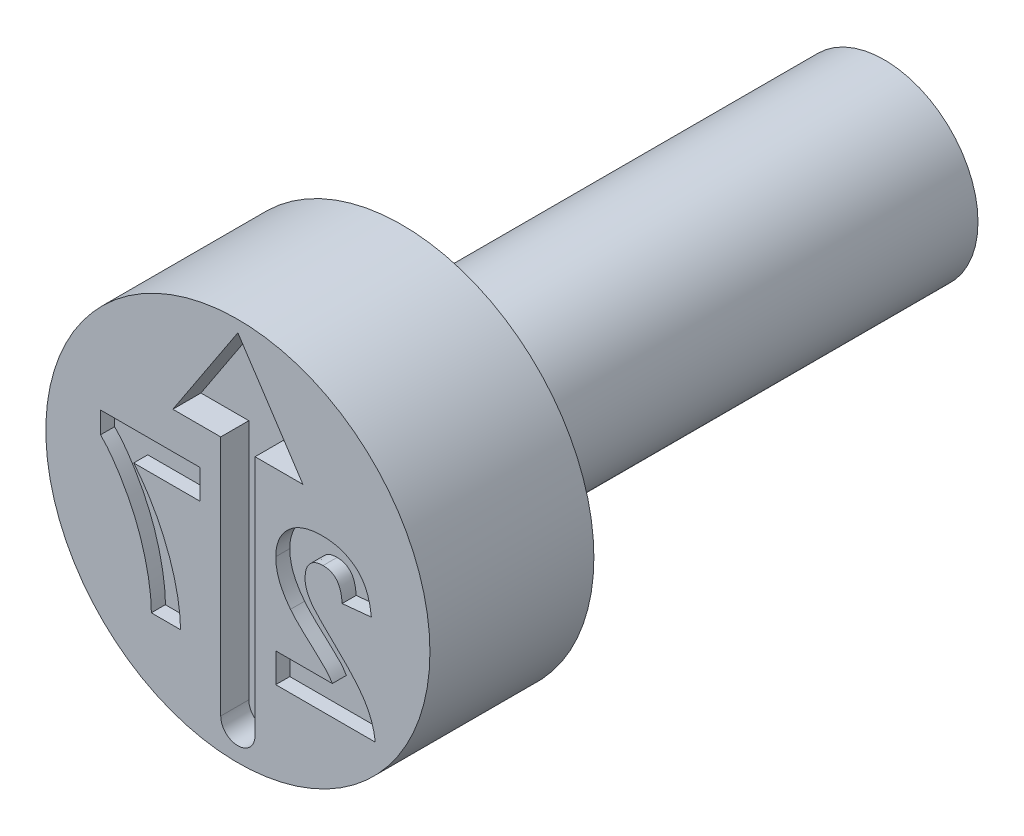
ISO-10303-21;
HEADER;
FILE_DESCRIPTION(('STEP AP214'),'2;1');
FILE_NAME('part.step','',(''),(''),'','','');
FILE_SCHEMA(('AUTOMOTIVE_DESIGN { 1 0 10303 214 1 1 1 1 }'));
ENDSEC;
DATA;
#1=APPLICATION_CONTEXT('core data for automotive mechanical design processes');
#2=APPLICATION_PROTOCOL_DEFINITION('international standard','automotive_design',2000,#1);
#3=PRODUCT_CONTEXT('',#1,'mechanical');
#4=PRODUCT('Part','Part','',(#3));
#5=PRODUCT_RELATED_PRODUCT_CATEGORY('part','',(#4));
#6=PRODUCT_DEFINITION_FORMATION('','',#4);
#7=PRODUCT_DEFINITION_CONTEXT('part definition',#1,'design');
#8=PRODUCT_DEFINITION('design','',#6,#7);
#9=PRODUCT_DEFINITION_SHAPE('','',#8);
#10=(LENGTH_UNIT() NAMED_UNIT(*) SI_UNIT(.MILLI.,.METRE.));
#11=(NAMED_UNIT(*) PLANE_ANGLE_UNIT() SI_UNIT($,.RADIAN.));
#12=(NAMED_UNIT(*) SI_UNIT($,.STERADIAN.) SOLID_ANGLE_UNIT());
#13=UNCERTAINTY_MEASURE_WITH_UNIT(LENGTH_MEASURE(1.E-05),#10,'distance_accuracy_value','');
#14=(GEOMETRIC_REPRESENTATION_CONTEXT(3) GLOBAL_UNCERTAINTY_ASSIGNED_CONTEXT((#13)) GLOBAL_UNIT_ASSIGNED_CONTEXT((#10,
#11,#12)) REPRESENTATION_CONTEXT('',''));
#15=CARTESIAN_POINT('',(0.,0.,0.));
#16=DIRECTION('',(0.,0.,1.));
#17=DIRECTION('',(1.,0.,0.));
#18=AXIS2_PLACEMENT_3D('',#15,#16,#17);
#19=CARTESIAN_POINT('',(0.,2.,-3.5));
#20=DIRECTION('',(0.,0.,1.));
#21=DIRECTION('',(1.,0.,0.));
#22=AXIS2_PLACEMENT_3D('',#19,#20,#21);
#23=PLANE('',#22);
#24=CARTESIAN_POINT('',(0.,0.,-3.5));
#25=DIRECTION('',(0.,0.,1.));
#26=DIRECTION('',(1.,0.,0.));
#27=AXIS2_PLACEMENT_3D('',#24,#25,#26);
#28=CIRCLE('',#27,4.1);
#29=CARTESIAN_POINT('',(4.1,0.,-3.5));
#30=VERTEX_POINT('',#29);
#31=EDGE_CURVE('E11',#30,#30,#28,.T.);
#32=ORIENTED_EDGE('',*,*,#31,.F.);
#33=EDGE_LOOP('',(#32));
#34=FACE_BOUND('',#33,.T.);
#35=CARTESIAN_POINT('',(0.,0.,-3.5));
#36=DIRECTION('',(0.,0.,1.));
#37=DIRECTION('',(1.,0.,0.));
#38=AXIS2_PLACEMENT_3D('',#35,#36,#37);
#39=CIRCLE('',#38,2.);
#40=CARTESIAN_POINT('',(2.,0.,-3.5));
#41=VERTEX_POINT('',#40);
#42=EDGE_CURVE('E462',#41,#41,#39,.T.);
#43=ORIENTED_EDGE('',*,*,#42,.T.);
#44=EDGE_LOOP('',(#43));
#45=FACE_BOUND('',#44,.T.);
#46=ADVANCED_FACE('F39',(#34,#45),#23,.F.);
#47=CARTESIAN_POINT('',(0.,0.,-0.403888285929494));
#48=DIRECTION('',(0.,0.,1.));
#49=DIRECTION('',(1.,0.,0.));
#50=AXIS2_PLACEMENT_3D('',#47,#48,#49);
#51=CYLINDRICAL_SURFACE('',#50,4.1);
#52=CARTESIAN_POINT('',(0.,0.,0.));
#53=DIRECTION('',(0.,0.,1.));
#54=DIRECTION('',(1.,0.,0.));
#55=AXIS2_PLACEMENT_3D('',#52,#53,#54);
#56=CIRCLE('',#55,4.1);
#57=CARTESIAN_POINT('',(4.1,0.,0.));
#58=VERTEX_POINT('',#57);
#59=EDGE_CURVE('E46',#58,#58,#56,.T.);
#60=ORIENTED_EDGE('',*,*,#59,.F.);
#61=EDGE_LOOP('',(#60));
#62=FACE_BOUND('',#61,.T.);
#63=ORIENTED_EDGE('',*,*,#31,.T.);
#64=EDGE_LOOP('',(#63));
#65=FACE_BOUND('',#64,.T.);
#66=ADVANCED_FACE('F484',(#62,#65),#51,.T.);
#67=CARTESIAN_POINT('',(0.,4.1,0.));
#68=DIRECTION('',(0.,0.,-1.));
#69=DIRECTION('',(-1.,0.,0.));
#70=AXIS2_PLACEMENT_3D('',#67,#68,#69);
#71=PLANE('',#70);
#72=DIRECTION('',(0.,1.,0.));
#73=VECTOR('',#72,1.);
#74=CARTESIAN_POINT('',(-0.806666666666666,0.333333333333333,0.));
#75=LINE('',#74,#73);
#76=CARTESIAN_POINT('',(-0.806666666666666,0.333333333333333,0.));
#77=VERTEX_POINT('',#76);
#78=CARTESIAN_POINT('',(-0.806666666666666,0.958333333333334,0.));
#79=VERTEX_POINT('',#78);
#80=EDGE_CURVE('E708',#77,#79,#75,.T.);
#81=ORIENTED_EDGE('',*,*,#80,.F.);
#82=DIRECTION('',(1.,0.,0.));
#83=VECTOR('',#82,1.);
#84=CARTESIAN_POINT('',(-2.223984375,0.333333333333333,0.));
#85=LINE('',#84,#83);
#86=CARTESIAN_POINT('',(-2.223984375,0.333333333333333,0.));
#87=VERTEX_POINT('',#86);
#88=EDGE_CURVE('E53',#87,#77,#85,.T.);
#89=ORIENTED_EDGE('',*,*,#88,.F.);
#90=CARTESIAN_POINT('',(-1.22333333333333,-2.25,0.));
#91=CARTESIAN_POINT('',(-1.22542319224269,-2.19463233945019,0.));
#92=CARTESIAN_POINT('',(-1.22962612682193,-2.08328192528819,0.));
#93=CARTESIAN_POINT('',(-1.24535119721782,-1.91614858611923,0.));
#94=CARTESIAN_POINT('',(-1.27004911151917,-1.74839291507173,0.));
#95=CARTESIAN_POINT('',(-1.30072557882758,-1.57962719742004,0.));
#96=CARTESIAN_POINT('',(-1.34122616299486,-1.41026228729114,0.));
#97=CARTESIAN_POINT('',(-1.38744973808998,-1.23967080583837,0.));
#98=CARTESIAN_POINT('',(-1.44344264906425,-1.06876387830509,0.));
#99=CARTESIAN_POINT('',(-1.50620919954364,-0.897868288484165,0.));
#100=CARTESIAN_POINT('',(-1.575500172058,-0.728606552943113,0.));
#101=CARTESIAN_POINT('',(-1.65101758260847,-0.563078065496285,0.));
#102=CARTESIAN_POINT('',(-1.73256621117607,-0.402315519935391,0.));
#103=CARTESIAN_POINT('',(-1.81908553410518,-0.245754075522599,0.));
#104=CARTESIAN_POINT('',(-1.91158207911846,-0.0938974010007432,0.));
#105=CARTESIAN_POINT('',(-2.01012548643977,0.0530896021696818,0.));
#106=CARTESIAN_POINT('',(-2.11331794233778,0.196270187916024,0.));
#107=CARTESIAN_POINT('',(-2.18710177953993,0.287653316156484,0.));
#108=CARTESIAN_POINT('',(-2.223984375,0.333333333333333,0.));
#109=B_SPLINE_CURVE_WITH_KNOTS('',3,(#90,#91,#92,#93,#94,#95,#96,#97,#98,#99,#100,#101,#102,
#103,#104,#105,#106,#107,#108),.UNSPECIFIED.,.F.,.F.,(4,1,1,1,1,1,1,1,1,1,1,1,1,1,1,1,4),(0.,
0.0589531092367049,0.118561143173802,0.178522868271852,0.239353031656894,0.301026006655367,
0.363773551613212,0.427382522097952,0.492333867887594,0.557475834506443,0.621960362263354,
0.685889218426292,0.749254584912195,0.812267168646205,0.875035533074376,0.937533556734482,1.),.UNSPECIFIED.);
#110=CARTESIAN_POINT('',(-1.22333333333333,-2.25,0.));
#111=VERTEX_POINT('',#110);
#112=EDGE_CURVE('E238',#111,#87,#109,.T.);
#113=ORIENTED_EDGE('',*,*,#112,.F.);
#114=DIRECTION('',(1.,0.,0.));
#115=VECTOR('',#114,1.);
#116=CARTESIAN_POINT('',(-1.84833333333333,-2.25,0.));
#117=LINE('',#116,#115);
#118=CARTESIAN_POINT('',(-1.84833333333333,-2.25,0.));
#119=VERTEX_POINT('',#118);
#120=EDGE_CURVE('E241',#119,#111,#117,.T.);
#121=ORIENTED_EDGE('',*,*,#120,.F.);
#122=CARTESIAN_POINT('',(-2.93166666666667,0.5,0.));
#123=CARTESIAN_POINT('',(-2.90949890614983,0.477445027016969,0.));
#124=CARTESIAN_POINT('',(-2.86392835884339,0.431078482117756,0.));
#125=CARTESIAN_POINT('',(-2.79865300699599,0.355195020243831,0.));
#126=CARTESIAN_POINT('',(-2.73241051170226,0.272848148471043,0.));
#127=CARTESIAN_POINT('',(-2.66658607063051,0.182928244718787,0.));
#128=CARTESIAN_POINT('',(-2.59913356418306,0.0868557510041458,0.));
#129=CARTESIAN_POINT('',(-2.53301729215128,-0.017210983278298,0.));
#130=CARTESIAN_POINT('',(-2.46596059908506,-0.127921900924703,0.));
#131=CARTESIAN_POINT('',(-2.37568108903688,-0.284522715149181,0.));
#132=CARTESIAN_POINT('',(-2.27015560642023,-0.489091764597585,0.));
#133=CARTESIAN_POINT('',(-2.15851522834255,-0.743381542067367,0.));
#134=CARTESIAN_POINT('',(-2.06340273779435,-1.00548079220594,0.));
#135=CARTESIAN_POINT('',(-1.9982738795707,-1.22880867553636,0.));
#136=CARTESIAN_POINT('',(-1.95426885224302,-1.40780563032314,0.));
#137=CARTESIAN_POINT('',(-1.92551809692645,-1.5386924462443,0.));
#138=CARTESIAN_POINT('',(-1.90131606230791,-1.66589593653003,0.));
#139=CARTESIAN_POINT('',(-1.8816277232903,-1.78963965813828,0.));
#140=CARTESIAN_POINT('',(-1.86693376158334,-1.90998006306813,0.));
#141=CARTESIAN_POINT('',(-1.85532302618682,-2.02649876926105,0.));
#142=CARTESIAN_POINT('',(-1.84959477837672,-2.13947990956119,0.));
#143=CARTESIAN_POINT('',(-1.84874951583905,-2.21353663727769,0.));
#144=CARTESIAN_POINT('',(-1.84833333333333,-2.25,0.));
#145=B_SPLINE_CURVE_WITH_KNOTS('',3,(#122,#123,#124,#125,#126,#127,#128,#129,#130,#131,#132,
#133,#134,#135,#136,#137,#138,#139,#140,#141,#142,#143,#144),.UNSPECIFIED.,.F.,.F.,(4,1,1,1,1,1,
1,1,1,1,1,1,1,1,1,1,1,1,1,1,4),(0.,0.0314272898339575,0.0646054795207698,0.0994393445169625,
0.136456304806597,0.175351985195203,0.216100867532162,0.258977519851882,0.304007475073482,
0.395756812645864,0.487615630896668,0.579873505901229,0.672707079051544,0.718694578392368,
0.76307923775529,0.805893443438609,0.847386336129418,0.88760014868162,0.926386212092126,
0.963754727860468,1.),.UNSPECIFIED.);
#146=CARTESIAN_POINT('',(-2.93166666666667,0.5,0.));
#147=VERTEX_POINT('',#146);
#148=EDGE_CURVE('E694',#147,#119,#145,.T.);
#149=ORIENTED_EDGE('',*,*,#148,.F.);
#150=DIRECTION('',(0.,-1.,0.));
#151=VECTOR('',#150,1.);
#152=CARTESIAN_POINT('',(-2.93166666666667,0.958333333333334,0.));
#153=LINE('',#152,#151);
#154=CARTESIAN_POINT('',(-2.93166666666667,0.958333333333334,0.));
#155=VERTEX_POINT('',#154);
#156=EDGE_CURVE('E699',#155,#147,#153,.T.);
#157=ORIENTED_EDGE('',*,*,#156,.F.);
#158=DIRECTION('',(-1.,0.,0.));
#159=VECTOR('',#158,1.);
#160=CARTESIAN_POINT('',(-0.806666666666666,0.958333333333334,0.));
#161=LINE('',#160,#159);
#162=EDGE_CURVE('E705',#79,#155,#161,.T.);
#163=ORIENTED_EDGE('',*,*,#162,.F.);
#164=EDGE_LOOP('',(#81,#89,#113,#121,#149,#157,#163));
#165=FACE_BOUND('',#164,.T.);
#166=DIRECTION('',(0.,-1.,0.));
#167=VECTOR('',#166,1.);
#168=CARTESIAN_POINT('',(0.808333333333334,-1.625,0.));
#169=LINE('',#168,#167);
#170=CARTESIAN_POINT('',(0.808333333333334,-1.625,0.));
#171=VERTEX_POINT('',#170);
#172=CARTESIAN_POINT('',(0.808333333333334,-2.25,0.));
#173=VERTEX_POINT('',#172);
#174=EDGE_CURVE('E310',#171,#173,#169,.T.);
#175=ORIENTED_EDGE('',*,*,#174,.F.);
#176=DIRECTION('',(-1.,0.,0.));
#177=VECTOR('',#176,1.);
#178=CARTESIAN_POINT('',(2.016015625,-1.625,0.));
#179=LINE('',#178,#177);
#180=CARTESIAN_POINT('',(2.016015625,-1.625,0.));
#181=VERTEX_POINT('',#180);
#182=EDGE_CURVE('E61',#181,#171,#179,.T.);
#183=ORIENTED_EDGE('',*,*,#182,.F.);
#184=CARTESIAN_POINT('',(1.1234375,-0.69921875,0.));
#185=CARTESIAN_POINT('',(1.13332267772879,-0.711669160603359,0.));
#186=CARTESIAN_POINT('',(1.15449443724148,-0.738335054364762,0.));
#187=CARTESIAN_POINT('',(1.19051316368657,-0.779223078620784,0.));
#188=CARTESIAN_POINT('',(1.2322557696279,-0.823885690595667,0.));
#189=CARTESIAN_POINT('',(1.27913265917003,-0.873158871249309,0.));
#190=CARTESIAN_POINT('',(1.33269226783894,-0.925297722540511,0.));
#191=CARTESIAN_POINT('',(1.39100751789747,-0.982482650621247,0.));
#192=CARTESIAN_POINT('',(1.45664445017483,-1.04178845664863,0.));
#193=CARTESIAN_POINT('',(1.52462840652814,-1.10469453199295,0.));
#194=CARTESIAN_POINT('',(1.59290786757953,-1.16592013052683,0.));
#195=CARTESIAN_POINT('',(1.65566653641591,-1.22407087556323,0.));
#196=CARTESIAN_POINT('',(1.71267229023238,-1.27552179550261,0.));
#197=CARTESIAN_POINT('',(1.76127026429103,-1.32311321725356,0.));
#198=CARTESIAN_POINT('',(1.80431897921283,-1.36359706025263,0.));
#199=CARTESIAN_POINT('',(1.84026681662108,-1.39904928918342,0.));
#200=CARTESIAN_POINT('',(1.86978644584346,-1.42861163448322,0.));
#201=CARTESIAN_POINT('',(1.91046259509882,-1.47469183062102,0.));
#202=CARTESIAN_POINT('',(1.96221837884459,-1.53701531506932,0.));
#203=CARTESIAN_POINT('',(1.99863068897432,-1.59656716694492,0.));
#204=CARTESIAN_POINT('',(2.016015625,-1.625,0.));
#205=B_SPLINE_CURVE_WITH_KNOTS('',3,(#184,#185,#186,#187,#188,#189,#190,#191,#192,#193,#194,
#195,#196,#197,#198,#199,#200,#201,#202,#203,#204),.UNSPECIFIED.,.F.,.F.,(4,1,1,1,1,1,1,1,1,1,1,
1,1,1,1,1,1,1,4),(0.,0.0369753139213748,0.0791925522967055,0.126700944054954,0.179184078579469,
0.23736864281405,0.300558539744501,0.369153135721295,0.443112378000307,0.516018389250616,
0.582473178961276,0.642136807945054,0.694619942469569,0.740679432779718,0.779589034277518,
0.812073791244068,0.837814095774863,0.922564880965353,1.),.UNSPECIFIED.);
#206=CARTESIAN_POINT('',(1.1234375,-0.69921875,0.));
#207=VERTEX_POINT('',#206);
#208=EDGE_CURVE('E381',#207,#181,#205,.T.);
#209=ORIENTED_EDGE('',*,*,#208,.F.);
#210=CARTESIAN_POINT('',(0.808333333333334,0.115885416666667,0.));
#211=CARTESIAN_POINT('',(0.809128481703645,0.0804589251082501,0.));
#212=CARTESIAN_POINT('',(0.810705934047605,0.0101782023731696,0.));
#213=CARTESIAN_POINT('',(0.825808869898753,-0.0937177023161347,0.));
#214=CARTESIAN_POINT('',(0.848883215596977,-0.195217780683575,0.));
#215=CARTESIAN_POINT('',(0.882985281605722,-0.294570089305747,0.));
#216=CARTESIAN_POINT('',(0.92621229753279,-0.394157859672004,0.));
#217=CARTESIAN_POINT('',(0.981932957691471,-0.494204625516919,0.));
#218=CARTESIAN_POINT('',(1.04662885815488,-0.597727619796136,0.));
#219=CARTESIAN_POINT('',(1.09728319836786,-0.664659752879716,0.));
#220=CARTESIAN_POINT('',(1.1234375,-0.69921875,0.));
#221=B_SPLINE_CURVE_WITH_KNOTS('',3,(#210,#211,#212,#213,#214,#215,#216,#217,#218,#219,#220),
.UNSPECIFIED.,.F.,.F.,(4,1,1,1,1,1,1,1,4),(0.,0.119176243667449,0.236427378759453,
0.352663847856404,0.469086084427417,0.589462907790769,0.717601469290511,0.854189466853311,1.),.UNSPECIFIED.);
#222=CARTESIAN_POINT('',(0.808333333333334,0.115885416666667,0.));
#223=VERTEX_POINT('',#222);
#224=EDGE_CURVE('E373',#223,#207,#221,.T.);
#225=ORIENTED_EDGE('',*,*,#224,.F.);
#226=CARTESIAN_POINT('',(1.80572916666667,1.,0.));
#227=CARTESIAN_POINT('',(1.76794079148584,0.999273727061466,0.));
#228=CARTESIAN_POINT('',(1.69434318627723,0.997859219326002,0.));
#229=CARTESIAN_POINT('',(1.58690374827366,0.986178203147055,0.));
#230=CARTESIAN_POINT('',(1.48597211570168,0.965810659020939,0.));
#231=CARTESIAN_POINT('',(1.39066587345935,0.938830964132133,0.));
#232=CARTESIAN_POINT('',(1.30196376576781,0.902811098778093,0.));
#233=CARTESIAN_POINT('',(1.2191266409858,0.859264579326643,0.));
#234=CARTESIAN_POINT('',(1.14345821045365,0.806538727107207,0.));
#235=CARTESIAN_POINT('',(1.07383053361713,0.747508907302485,0.));
#236=CARTESIAN_POINT('',(1.01158896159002,0.682595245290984,0.));
#237=CARTESIAN_POINT('',(0.957070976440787,0.613353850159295,0.));
#238=CARTESIAN_POINT('',(0.911395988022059,0.539832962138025,0.));
#239=CARTESIAN_POINT('',(0.873067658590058,0.462928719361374,0.));
#240=CARTESIAN_POINT('',(0.84460913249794,0.381403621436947,0.));
#241=CARTESIAN_POINT('',(0.823873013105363,0.296384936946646,0.));
#242=CARTESIAN_POINT('',(0.810124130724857,0.207476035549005,0.));
#243=CARTESIAN_POINT('',(0.808936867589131,0.146753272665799,0.));
#244=CARTESIAN_POINT('',(0.808333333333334,0.115885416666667,0.));
#245=B_SPLINE_CURVE_WITH_KNOTS('',3,(#226,#227,#228,#229,#230,#231,#232,#233,#234,#235,#236,
#237,#238,#239,#240,#241,#242,#243,#244),.UNSPECIFIED.,.F.,.F.,(4,1,1,1,1,1,1,1,1,1,1,1,1,1,1,1,
4),(0.,0.0756723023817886,0.147381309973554,0.216084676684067,0.281698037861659,
0.345459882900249,0.407485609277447,0.46873129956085,0.529782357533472,0.590032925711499,
0.648548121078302,0.70595351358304,0.763101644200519,0.820289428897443,0.878479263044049,
0.938226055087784,1.),.UNSPECIFIED.);
#246=CARTESIAN_POINT('',(1.80572916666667,1.,0.));
#247=VERTEX_POINT('',#246);
#248=EDGE_CURVE('E365',#247,#223,#245,.T.);
#249=ORIENTED_EDGE('',*,*,#248,.F.);
#250=CARTESIAN_POINT('',(2.85,0.01953125,0.));
#251=CARTESIAN_POINT('',(2.84497509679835,0.0617266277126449,0.));
#252=CARTESIAN_POINT('',(2.83523261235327,0.14353672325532,0.));
#253=CARTESIAN_POINT('',(2.81092007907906,0.261044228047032,0.));
#254=CARTESIAN_POINT('',(2.78012915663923,0.369450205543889,0.));
#255=CARTESIAN_POINT('',(2.74139193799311,0.468553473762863,0.));
#256=CARTESIAN_POINT('',(2.6963094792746,0.558984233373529,0.));
#257=CARTESIAN_POINT('',(2.64258220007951,0.639385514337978,0.));
#258=CARTESIAN_POINT('',(2.58208738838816,0.71064793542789,0.));
#259=CARTESIAN_POINT('',(2.51477276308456,0.77273356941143,0.));
#260=CARTESIAN_POINT('',(2.44106626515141,0.825839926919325,0.));
#261=CARTESIAN_POINT('',(2.36372452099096,0.873245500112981,0.));
#262=CARTESIAN_POINT('',(2.28123605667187,0.912133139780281,0.));
#263=CARTESIAN_POINT('',(2.19450907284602,0.944182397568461,0.));
#264=CARTESIAN_POINT('',(2.10358276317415,0.969795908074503,0.));
#265=CARTESIAN_POINT('',(2.00803658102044,0.986731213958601,0.));
#266=CARTESIAN_POINT('',(1.90846020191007,0.998643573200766,0.));
#267=CARTESIAN_POINT('',(1.84048894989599,0.99954104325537,0.));
#268=CARTESIAN_POINT('',(1.80572916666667,1.,0.));
#269=B_SPLINE_CURVE_WITH_KNOTS('',3,(#250,#251,#252,#253,#254,#255,#256,#257,#258,#259,#260,
#261,#262,#263,#264,#265,#266,#267,#268),.UNSPECIFIED.,.F.,.F.,(4,1,1,1,1,1,1,1,1,1,1,1,1,1,1,1,
4),(0.,0.0794357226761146,0.154013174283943,0.224141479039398,0.289934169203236,
0.352732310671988,0.41272577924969,0.470302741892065,0.527168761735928,0.583502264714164,
0.639948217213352,0.696584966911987,0.753726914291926,0.812707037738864,0.872963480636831,
0.935034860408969,1.),.UNSPECIFIED.);
#270=CARTESIAN_POINT('',(2.85,0.01953125,0.));
#271=VERTEX_POINT('',#270);
#272=EDGE_CURVE('E360',#271,#247,#269,.T.);
#273=ORIENTED_EDGE('',*,*,#272,.F.);
#274=DIRECTION('',(0.995240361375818,0.0974506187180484,0.));
#275=VECTOR('',#274,1.);
#276=CARTESIAN_POINT('',(2.225,-0.0416666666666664,0.));
#277=LINE('',#276,#275);
#278=CARTESIAN_POINT('',(2.225,-0.0416666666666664,0.));
#279=VERTEX_POINT('',#278);
#280=EDGE_CURVE('E354',#279,#271,#277,.T.);
#281=ORIENTED_EDGE('',*,*,#280,.F.);
#282=CARTESIAN_POINT('',(1.81875,0.458333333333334,0.));
#283=CARTESIAN_POINT('',(1.84709727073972,0.457049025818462,0.));
#284=CARTESIAN_POINT('',(1.90185807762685,0.454568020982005,0.));
#285=CARTESIAN_POINT('',(1.97968506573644,0.432894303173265,0.));
#286=CARTESIAN_POINT('',(2.04776931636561,0.395374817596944,0.));
#287=CARTESIAN_POINT('',(2.09628977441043,0.352617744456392,0.));
#288=CARTESIAN_POINT('',(2.12906764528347,0.311039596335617,0.));
#289=CARTESIAN_POINT('',(2.15140134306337,0.27480697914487,0.));
#290=CARTESIAN_POINT('',(2.17065124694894,0.233635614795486,0.));
#291=CARTESIAN_POINT('',(2.18770826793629,0.187989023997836,0.));
#292=CARTESIAN_POINT('',(2.20118138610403,0.137344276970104,0.));
#293=CARTESIAN_POINT('',(2.21203179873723,0.0820870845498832,0.));
#294=CARTESIAN_POINT('',(2.22077566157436,0.0219200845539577,0.));
#295=CARTESIAN_POINT('',(2.22355636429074,-0.0199363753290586,0.));
#296=CARTESIAN_POINT('',(2.225,-0.0416666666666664,0.));
#297=B_SPLINE_CURVE_WITH_KNOTS('',3,(#282,#283,#284,#285,#286,#287,#288,#289,#290,#291,#292,
#293,#294,#295,#296),.UNSPECIFIED.,.F.,.F.,(4,1,1,1,1,1,1,1,1,1,1,1,4),(0.,0.116899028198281,
0.225823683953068,0.330086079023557,0.435451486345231,0.490306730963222,0.548244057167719,
0.610766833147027,0.677675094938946,0.749188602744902,0.826858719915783,0.910111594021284,1.),.UNSPECIFIED.);
#298=CARTESIAN_POINT('',(1.81875,0.458333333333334,0.));
#299=VERTEX_POINT('',#298);
#300=EDGE_CURVE('E346',#299,#279,#297,.T.);
#301=ORIENTED_EDGE('',*,*,#300,.F.);
#302=CARTESIAN_POINT('',(1.43333333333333,0.0319010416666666,0.));
#303=CARTESIAN_POINT('',(1.43450387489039,0.0643275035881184,0.));
#304=CARTESIAN_POINT('',(1.43671844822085,0.125675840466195,0.));
#305=CARTESIAN_POINT('',(1.45528802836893,0.212249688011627,0.));
#306=CARTESIAN_POINT('',(1.48821816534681,0.286672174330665,0.));
#307=CARTESIAN_POINT('',(1.53355690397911,0.349171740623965,0.));
#308=CARTESIAN_POINT('',(1.59088782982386,0.398139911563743,0.));
#309=CARTESIAN_POINT('',(1.65790934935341,0.434322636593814,0.));
#310=CARTESIAN_POINT('',(1.73560255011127,0.454326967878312,0.));
#311=CARTESIAN_POINT('',(1.79020991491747,0.45695816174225,0.));
#312=CARTESIAN_POINT('',(1.81875,0.458333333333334,0.));
#313=B_SPLINE_CURVE_WITH_KNOTS('',3,(#302,#303,#304,#305,#306,#307,#308,#309,#310,#311,#312),
.UNSPECIFIED.,.F.,.F.,(4,1,1,1,1,1,1,1,4),(0.,0.149140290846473,0.282161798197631,
0.404655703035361,0.521109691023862,0.634416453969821,0.748796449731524,0.868710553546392,1.),.UNSPECIFIED.);
#314=CARTESIAN_POINT('',(1.43333333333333,0.0319010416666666,0.));
#315=VERTEX_POINT('',#314);
#316=EDGE_CURVE('E338',#315,#299,#313,.T.);
#317=ORIENTED_EDGE('',*,*,#316,.F.);
#318=CARTESIAN_POINT('',(1.55703125,-0.34375,0.));
#319=CARTESIAN_POINT('',(1.53821390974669,-0.312492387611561,0.));
#320=CARTESIAN_POINT('',(1.50191744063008,-0.252200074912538,0.));
#321=CARTESIAN_POINT('',(1.46211535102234,-0.157389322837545,0.));
#322=CARTESIAN_POINT('',(1.43822465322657,-0.0625981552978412,0.));
#323=CARTESIAN_POINT('',(1.43494620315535,0.000740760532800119,0.));
#324=CARTESIAN_POINT('',(1.43333333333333,0.0319010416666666,0.));
#325=B_SPLINE_CURVE_WITH_KNOTS('',3,(#318,#319,#320,#321,#322,#323,#324),.UNSPECIFIED.,.F.,.F.,
(4,1,1,1,4),(0.,0.272795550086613,0.526191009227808,0.766904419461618,1.),.UNSPECIFIED.);
#326=CARTESIAN_POINT('',(1.55703125,-0.34375,0.));
#327=VERTEX_POINT('',#326);
#328=EDGE_CURVE('E330',#327,#315,#325,.T.);
#329=ORIENTED_EDGE('',*,*,#328,.F.);
#330=CARTESIAN_POINT('',(2.05442708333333,-0.868489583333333,0.));
#331=CARTESIAN_POINT('',(2.02229423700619,-0.837472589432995,0.));
#332=CARTESIAN_POINT('',(1.9611227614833,-0.778425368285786,0.));
#333=CARTESIAN_POINT('',(1.87401446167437,-0.693872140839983,0.));
#334=CARTESIAN_POINT('',(1.79743729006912,-0.616143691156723,0.));
#335=CARTESIAN_POINT('',(1.72979012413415,-0.547254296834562,0.));
#336=CARTESIAN_POINT('',(1.67263570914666,-0.4854498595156,0.));
#337=CARTESIAN_POINT('',(1.62522223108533,-0.431701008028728,0.));
#338=CARTESIAN_POINT('',(1.58694920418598,-0.385788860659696,0.));
#339=CARTESIAN_POINT('',(1.56622049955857,-0.356662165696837,0.));
#340=CARTESIAN_POINT('',(1.55703125,-0.34375,0.));
#341=B_SPLINE_CURVE_WITH_KNOTS('',3,(#330,#331,#332,#333,#334,#335,#336,#337,#338,#339,#340),
.UNSPECIFIED.,.F.,.F.,(4,1,1,1,1,1,1,1,4),(0.,0.18509006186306,0.352356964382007,
0.503079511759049,0.637279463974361,0.752473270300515,0.851885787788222,0.934339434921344,1.),.UNSPECIFIED.);
#342=CARTESIAN_POINT('',(2.05442708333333,-0.868489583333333,0.));
#343=VERTEX_POINT('',#342);
#344=EDGE_CURVE('E322',#343,#327,#341,.T.);
#345=ORIENTED_EDGE('',*,*,#344,.F.);
#346=CARTESIAN_POINT('',(2.93333333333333,-2.25,0.));
#347=CARTESIAN_POINT('',(2.92613857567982,-2.19658468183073,0.));
#348=CARTESIAN_POINT('',(2.91175309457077,-2.08978399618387,0.));
#349=CARTESIAN_POINT('',(2.8672783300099,-1.93377507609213,0.));
#350=CARTESIAN_POINT('',(2.80791975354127,-1.7815370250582,0.));
#351=CARTESIAN_POINT('',(2.7434972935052,-1.65765220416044,0.));
#352=CARTESIAN_POINT('',(2.67942202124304,-1.55792918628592,0.));
#353=CARTESIAN_POINT('',(2.6212865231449,-1.47621537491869,0.));
#354=CARTESIAN_POINT('',(2.55193300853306,-1.38927538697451,0.));
#355=CARTESIAN_POINT('',(2.47236787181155,-1.29640737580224,0.));
#356=CARTESIAN_POINT('',(2.38303082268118,-1.19732103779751,0.));
#357=CARTESIAN_POINT('',(2.28325534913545,-1.09238475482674,0.));
#358=CARTESIAN_POINT('',(2.17256550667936,-0.982100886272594,0.));
#359=CARTESIAN_POINT('',(2.09469323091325,-0.907212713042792,0.));
#360=CARTESIAN_POINT('',(2.05442708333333,-0.868489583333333,0.));
#361=B_SPLINE_CURVE_WITH_KNOTS('',3,(#346,#347,#348,#349,#350,#351,#352,#353,#354,#355,#356,
#357,#358,#359,#360),.UNSPECIFIED.,.F.,.F.,(4,1,1,1,1,1,1,1,1,1,1,1,4),(0.,0.0963574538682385,
0.192660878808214,0.289454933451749,0.388479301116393,0.441921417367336,0.501521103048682,
0.567882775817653,0.640891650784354,0.72037065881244,0.806636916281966,0.900015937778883,1.),.UNSPECIFIED.);
#362=CARTESIAN_POINT('',(2.93333333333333,-2.25,0.));
#363=VERTEX_POINT('',#362);
#364=EDGE_CURVE('E317',#363,#343,#361,.T.);
#365=ORIENTED_EDGE('',*,*,#364,.F.);
#366=DIRECTION('',(1.,0.,0.));
#367=VECTOR('',#366,1.);
#368=CARTESIAN_POINT('',(0.808333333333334,-2.25,0.));
#369=LINE('',#368,#367);
#370=EDGE_CURVE('E314',#173,#363,#369,.T.);
#371=ORIENTED_EDGE('',*,*,#370,.F.);
#372=EDGE_LOOP('',(#175,#183,#209,#225,#249,#273,#281,#301,#317,#329,#345,#365,#371));
#373=FACE_BOUND('',#372,.T.);
#374=DIRECTION('',(0.,1.,0.));
#375=VECTOR('',#374,1.);
#376=CARTESIAN_POINT('',(0.366422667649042,1.74359356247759,0.));
#377=LINE('',#376,#375);
#378=CARTESIAN_POINT('',(0.366422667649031,-3.4168913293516,0.));
#379=VERTEX_POINT('',#378);
#380=CARTESIAN_POINT('',(0.366422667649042,1.74359356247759,0.));
#381=VERTEX_POINT('',#380);
#382=EDGE_CURVE('E443',#379,#381,#377,.T.);
#383=ORIENTED_EDGE('',*,*,#382,.F.);
#384=CARTESIAN_POINT('',(3.14387868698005E-13,-3.4168913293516,0.));
#385=DIRECTION('',(0.,0.,1.));
#386=DIRECTION('',(1.,0.,0.));
#387=AXIS2_PLACEMENT_3D('',#384,#385,#386);
#388=CIRCLE('',#387,0.366422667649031);
#389=CARTESIAN_POINT('',(-0.366422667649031,-3.4168913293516,0.));
#390=VERTEX_POINT('',#389);
#391=EDGE_CURVE('E395',#390,#379,#388,.T.);
#392=ORIENTED_EDGE('',*,*,#391,.F.);
#393=DIRECTION('',(0.,-1.,0.));
#394=VECTOR('',#393,1.);
#395=CARTESIAN_POINT('',(-0.366422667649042,1.74359356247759,0.));
#396=LINE('',#395,#394);
#397=CARTESIAN_POINT('',(-0.366422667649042,1.74359356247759,0.));
#398=VERTEX_POINT('',#397);
#399=EDGE_CURVE('E423',#398,#390,#396,.T.);
#400=ORIENTED_EDGE('',*,*,#399,.F.);
#401=DIRECTION('',(1.,0.,0.));
#402=VECTOR('',#401,1.);
#403=CARTESIAN_POINT('',(-1.38878912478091,1.74359356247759,0.));
#404=LINE('',#403,#402);
#405=CARTESIAN_POINT('',(-1.38878912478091,1.74359356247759,0.));
#406=VERTEX_POINT('',#405);
#407=EDGE_CURVE('E455',#406,#398,#404,.T.);
#408=ORIENTED_EDGE('',*,*,#407,.F.);
#409=DIRECTION('',(-0.550159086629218,-0.835059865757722,0.));
#410=VECTOR('',#409,1.);
#411=CARTESIAN_POINT('',(0.,3.85156939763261,0.));
#412=LINE('',#411,#410);
#413=CARTESIAN_POINT('',(0.,3.85156939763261,0.));
#414=VERTEX_POINT('',#413);
#415=EDGE_CURVE('E452',#414,#406,#412,.T.);
#416=ORIENTED_EDGE('',*,*,#415,.F.);
#417=DIRECTION('',(-0.550159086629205,0.835059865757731,0.));
#418=VECTOR('',#417,1.);
#419=CARTESIAN_POINT('',(0.,3.85156939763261,0.));
#420=LINE('',#419,#418);
#421=CARTESIAN_POINT('',(1.38878912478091,1.74359356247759,0.));
#422=VERTEX_POINT('',#421);
#423=EDGE_CURVE('E449',#422,#414,#420,.T.);
#424=ORIENTED_EDGE('',*,*,#423,.F.);
#425=DIRECTION('',(1.,0.,0.));
#426=VECTOR('',#425,1.);
#427=CARTESIAN_POINT('',(1.38878912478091,1.74359356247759,0.));
#428=LINE('',#427,#426);
#429=EDGE_CURVE('E446',#381,#422,#428,.T.);
#430=ORIENTED_EDGE('',*,*,#429,.F.);
#431=EDGE_LOOP('',(#383,#392,#400,#408,#416,#424,#430));
#432=FACE_BOUND('',#431,.T.);
#433=ORIENTED_EDGE('',*,*,#59,.T.);
#434=EDGE_LOOP('',(#433));
#435=FACE_BOUND('',#434,.T.);
#436=ADVANCED_FACE('F482',(#165,#373,#432,#435),#71,.F.);
#437=CARTESIAN_POINT('',(0.,0.,-13.8));
#438=DIRECTION('',(0.,0.,1.));
#439=DIRECTION('',(1.,0.,0.));
#440=AXIS2_PLACEMENT_3D('',#437,#438,#439);
#441=PLANE('',#440);
#442=CARTESIAN_POINT('',(0.,0.,-13.8));
#443=DIRECTION('',(0.,0.,1.));
#444=DIRECTION('',(1.,0.,0.));
#445=AXIS2_PLACEMENT_3D('',#442,#443,#444);
#446=CIRCLE('',#445,2.);
#447=CARTESIAN_POINT('',(2.,0.,-13.8));
#448=VERTEX_POINT('',#447);
#449=EDGE_CURVE('E477',#448,#448,#446,.T.);
#450=ORIENTED_EDGE('',*,*,#449,.F.);
#451=EDGE_LOOP('',(#450));
#452=FACE_BOUND('',#451,.T.);
#453=ADVANCED_FACE('F497',(#452),#441,.F.);
#454=CARTESIAN_POINT('',(0.,0.,-0.403888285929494));
#455=DIRECTION('',(0.,0.,1.));
#456=DIRECTION('',(1.,0.,0.));
#457=AXIS2_PLACEMENT_3D('',#454,#455,#456);
#458=CYLINDRICAL_SURFACE('',#457,2.);
#459=ORIENTED_EDGE('',*,*,#42,.F.);
#460=EDGE_LOOP('',(#459));
#461=FACE_BOUND('',#460,.T.);
#462=ORIENTED_EDGE('',*,*,#449,.T.);
#463=EDGE_LOOP('',(#462));
#464=FACE_BOUND('',#463,.T.);
#465=ADVANCED_FACE('F493',(#461,#464),#458,.T.);
#466=CARTESIAN_POINT('',(3.14387868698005E-13,-3.4168913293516,-0.6));
#467=DIRECTION('',(0.,0.,1.));
#468=DIRECTION('',(1.,0.,0.));
#469=AXIS2_PLACEMENT_3D('',#466,#467,#468);
#470=CYLINDRICAL_SURFACE('',#469,0.366422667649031);
#471=ORIENTED_EDGE('',*,*,#391,.T.);
#472=DIRECTION('',(0.,0.,1.));
#473=VECTOR('',#472,1.);
#474=CARTESIAN_POINT('',(0.366422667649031,-3.4168913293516,-0.6));
#475=LINE('',#474,#473);
#476=CARTESIAN_POINT('',(0.366422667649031,-3.4168913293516,-0.6));
#477=VERTEX_POINT('',#476);
#478=EDGE_CURVE('E441',#477,#379,#475,.T.);
#479=ORIENTED_EDGE('',*,*,#478,.F.);
#480=CARTESIAN_POINT('',(3.14387868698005E-13,-3.4168913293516,-0.6));
#481=DIRECTION('',(0.,0.,1.));
#482=DIRECTION('',(1.,0.,0.));
#483=AXIS2_PLACEMENT_3D('',#480,#481,#482);
#484=CIRCLE('',#483,0.366422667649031);
#485=CARTESIAN_POINT('',(-0.366422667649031,-3.4168913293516,-0.6));
#486=VERTEX_POINT('',#485);
#487=EDGE_CURVE('E419',#486,#477,#484,.T.);
#488=ORIENTED_EDGE('',*,*,#487,.F.);
#489=DIRECTION('',(0.,0.,1.));
#490=VECTOR('',#489,1.);
#491=CARTESIAN_POINT('',(-0.366422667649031,-3.4168913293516,-0.6));
#492=LINE('',#491,#490);
#493=EDGE_CURVE('E460',#486,#390,#492,.T.);
#494=ORIENTED_EDGE('',*,*,#493,.T.);
#495=EDGE_LOOP('',(#471,#479,#488,#494));
#496=FACE_BOUND('',#495,.T.);
#497=ADVANCED_FACE('F496',(#496),#470,.F.);
#498=CARTESIAN_POINT('',(-0.366422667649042,1.74359356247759,-0.6));
#499=DIRECTION('',(-1.,0.,0.));
#500=DIRECTION('',(0.,-1.,0.));
#501=AXIS2_PLACEMENT_3D('',#498,#499,#500);
#502=PLANE('',#501);
#503=ORIENTED_EDGE('',*,*,#399,.T.);
#504=ORIENTED_EDGE('',*,*,#493,.F.);
#505=DIRECTION('',(0.,-1.,0.));
#506=VECTOR('',#505,1.);
#507=CARTESIAN_POINT('',(-0.366422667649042,1.74359356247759,-0.6));
#508=LINE('',#507,#506);
#509=CARTESIAN_POINT('',(-0.366422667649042,1.74359356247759,-0.6));
#510=VERTEX_POINT('',#509);
#511=EDGE_CURVE('E438',#510,#486,#508,.T.);
#512=ORIENTED_EDGE('',*,*,#511,.F.);
#513=DIRECTION('',(0.,0.,1.));
#514=VECTOR('',#513,1.);
#515=CARTESIAN_POINT('',(-0.366422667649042,1.74359356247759,-0.6));
#516=LINE('',#515,#514);
#517=EDGE_CURVE('E463',#510,#398,#516,.T.);
#518=ORIENTED_EDGE('',*,*,#517,.T.);
#519=EDGE_LOOP('',(#503,#504,#512,#518));
#520=FACE_BOUND('',#519,.T.);
#521=ADVANCED_FACE('F511',(#520),#502,.F.);
#522=CARTESIAN_POINT('',(-1.38878912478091,1.74359356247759,-0.6));
#523=DIRECTION('',(0.,-1.,0.));
#524=DIRECTION('',(0.,0.,-1.));
#525=AXIS2_PLACEMENT_3D('',#522,#523,#524);
#526=PLANE('',#525);
#527=ORIENTED_EDGE('',*,*,#407,.T.);
#528=ORIENTED_EDGE('',*,*,#517,.F.);
#529=DIRECTION('',(1.,0.,0.));
#530=VECTOR('',#529,1.);
#531=CARTESIAN_POINT('',(-1.38878912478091,1.74359356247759,-0.6));
#532=LINE('',#531,#530);
#533=CARTESIAN_POINT('',(-1.38878912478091,1.74359356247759,-0.6));
#534=VERTEX_POINT('',#533);
#535=EDGE_CURVE('E435',#534,#510,#532,.T.);
#536=ORIENTED_EDGE('',*,*,#535,.F.);
#537=DIRECTION('',(0.,0.,1.));
#538=VECTOR('',#537,1.);
#539=CARTESIAN_POINT('',(-1.38878912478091,1.74359356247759,-0.6));
#540=LINE('',#539,#538);
#541=EDGE_CURVE('E465',#534,#406,#540,.T.);
#542=ORIENTED_EDGE('',*,*,#541,.T.);
#543=EDGE_LOOP('',(#527,#528,#536,#542));
#544=FACE_BOUND('',#543,.T.);
#545=ADVANCED_FACE('F529',(#544),#526,.F.);
#546=CARTESIAN_POINT('',(0.,3.85156939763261,-0.6));
#547=DIRECTION('',(-0.835059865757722,0.550159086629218,0.));
#548=DIRECTION('',(-0.550159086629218,-0.835059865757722,0.));
#549=AXIS2_PLACEMENT_3D('',#546,#547,#548);
#550=PLANE('',#549);
#551=ORIENTED_EDGE('',*,*,#415,.T.);
#552=ORIENTED_EDGE('',*,*,#541,.F.);
#553=DIRECTION('',(-0.550159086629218,-0.835059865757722,0.));
#554=VECTOR('',#553,1.);
#555=CARTESIAN_POINT('',(0.,3.85156939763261,-0.6));
#556=LINE('',#555,#554);
#557=CARTESIAN_POINT('',(0.,3.85156939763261,-0.6));
#558=VERTEX_POINT('',#557);
#559=EDGE_CURVE('E432',#558,#534,#556,.T.);
#560=ORIENTED_EDGE('',*,*,#559,.F.);
#561=DIRECTION('',(0.,0.,1.));
#562=VECTOR('',#561,1.);
#563=CARTESIAN_POINT('',(0.,3.85156939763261,-0.6));
#564=LINE('',#563,#562);
#565=EDGE_CURVE('E467',#558,#414,#564,.T.);
#566=ORIENTED_EDGE('',*,*,#565,.T.);
#567=EDGE_LOOP('',(#551,#552,#560,#566));
#568=FACE_BOUND('',#567,.T.);
#569=ADVANCED_FACE('F525',(#568),#550,.F.);
#570=CARTESIAN_POINT('',(0.,3.85156939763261,-0.6));
#571=DIRECTION('',(0.835059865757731,0.550159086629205,0.));
#572=DIRECTION('',(-0.550159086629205,0.835059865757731,0.));
#573=AXIS2_PLACEMENT_3D('',#570,#571,#572);
#574=PLANE('',#573);
#575=ORIENTED_EDGE('',*,*,#423,.T.);
#576=ORIENTED_EDGE('',*,*,#565,.F.);
#577=DIRECTION('',(-0.550159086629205,0.835059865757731,0.));
#578=VECTOR('',#577,1.);
#579=CARTESIAN_POINT('',(0.,3.85156939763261,-0.6));
#580=LINE('',#579,#578);
#581=CARTESIAN_POINT('',(1.38878912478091,1.74359356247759,-0.6));
#582=VERTEX_POINT('',#581);
#583=EDGE_CURVE('E429',#582,#558,#580,.T.);
#584=ORIENTED_EDGE('',*,*,#583,.F.);
#585=DIRECTION('',(0.,0.,1.));
#586=VECTOR('',#585,1.);
#587=CARTESIAN_POINT('',(1.38878912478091,1.74359356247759,-0.6));
#588=LINE('',#587,#586);
#589=EDGE_CURVE('E469',#582,#422,#588,.T.);
#590=ORIENTED_EDGE('',*,*,#589,.T.);
#591=EDGE_LOOP('',(#575,#576,#584,#590));
#592=FACE_BOUND('',#591,.T.);
#593=ADVANCED_FACE('F521',(#592),#574,.F.);
#594=CARTESIAN_POINT('',(1.38878912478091,1.74359356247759,-0.6));
#595=DIRECTION('',(0.,-1.,0.));
#596=DIRECTION('',(0.,0.,-1.));
#597=AXIS2_PLACEMENT_3D('',#594,#595,#596);
#598=PLANE('',#597);
#599=ORIENTED_EDGE('',*,*,#429,.T.);
#600=ORIENTED_EDGE('',*,*,#589,.F.);
#601=DIRECTION('',(1.,0.,0.));
#602=VECTOR('',#601,1.);
#603=CARTESIAN_POINT('',(1.38878912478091,1.74359356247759,-0.6));
#604=LINE('',#603,#602);
#605=CARTESIAN_POINT('',(0.366422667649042,1.74359356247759,-0.6));
#606=VERTEX_POINT('',#605);
#607=EDGE_CURVE('E426',#606,#582,#604,.T.);
#608=ORIENTED_EDGE('',*,*,#607,.F.);
#609=DIRECTION('',(0.,0.,1.));
#610=VECTOR('',#609,1.);
#611=CARTESIAN_POINT('',(0.366422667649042,1.74359356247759,-0.6));
#612=LINE('',#611,#610);
#613=EDGE_CURVE('E471',#606,#381,#612,.T.);
#614=ORIENTED_EDGE('',*,*,#613,.T.);
#615=EDGE_LOOP('',(#599,#600,#608,#614));
#616=FACE_BOUND('',#615,.T.);
#617=ADVANCED_FACE('F517',(#616),#598,.F.);
#618=CARTESIAN_POINT('',(0.366422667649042,1.74359356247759,-0.6));
#619=DIRECTION('',(1.,0.,0.));
#620=DIRECTION('',(0.,1.,0.));
#621=AXIS2_PLACEMENT_3D('',#618,#619,#620);
#622=PLANE('',#621);
#623=ORIENTED_EDGE('',*,*,#382,.T.);
#624=ORIENTED_EDGE('',*,*,#613,.F.);
#625=DIRECTION('',(0.,1.,0.));
#626=VECTOR('',#625,1.);
#627=CARTESIAN_POINT('',(0.366422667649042,1.74359356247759,-0.6));
#628=LINE('',#627,#626);
#629=EDGE_CURVE('E422',#477,#606,#628,.T.);
#630=ORIENTED_EDGE('',*,*,#629,.F.);
#631=ORIENTED_EDGE('',*,*,#478,.T.);
#632=EDGE_LOOP('',(#623,#624,#630,#631));
#633=FACE_BOUND('',#632,.T.);
#634=ADVANCED_FACE('F513',(#633),#622,.F.);
#635=CARTESIAN_POINT('',(3.14387868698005E-13,-3.4168913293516,-0.6));
#636=DIRECTION('',(0.,0.,1.));
#637=DIRECTION('',(1.,0.,0.));
#638=AXIS2_PLACEMENT_3D('',#635,#636,#637);
#639=PLANE('',#638);
#640=ORIENTED_EDGE('',*,*,#487,.T.);
#641=ORIENTED_EDGE('',*,*,#629,.T.);
#642=ORIENTED_EDGE('',*,*,#607,.T.);
#643=ORIENTED_EDGE('',*,*,#583,.T.);
#644=ORIENTED_EDGE('',*,*,#559,.T.);
#645=ORIENTED_EDGE('',*,*,#535,.T.);
#646=ORIENTED_EDGE('',*,*,#511,.T.);
#647=EDGE_LOOP('',(#640,#641,#642,#643,#644,#645,#646));
#648=FACE_BOUND('',#647,.T.);
#649=ADVANCED_FACE('F516',(#648),#639,.T.);
#650=CARTESIAN_POINT('',(2.016015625,-1.625,-0.3));
#651=DIRECTION('',(0.,1.,0.));
#652=DIRECTION('',(0.,0.,1.));
#653=AXIS2_PLACEMENT_3D('',#650,#651,#652);
#654=PLANE('',#653);
#655=ORIENTED_EDGE('',*,*,#182,.T.);
#656=DIRECTION('',(0.,0.,1.));
#657=VECTOR('',#656,1.);
#658=CARTESIAN_POINT('',(0.808333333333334,-1.625,-0.3));
#659=LINE('',#658,#657);
#660=CARTESIAN_POINT('',(0.808333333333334,-1.625,-0.3));
#661=VERTEX_POINT('',#660);
#662=EDGE_CURVE('E300',#661,#171,#659,.T.);
#663=ORIENTED_EDGE('',*,*,#662,.F.);
#664=DIRECTION('',(-1.,0.,0.));
#665=VECTOR('',#664,1.);
#666=CARTESIAN_POINT('',(2.016015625,-1.625,-0.3));
#667=LINE('',#666,#665);
#668=CARTESIAN_POINT('',(2.016015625,-1.625,-0.3));
#669=VERTEX_POINT('',#668);
#670=EDGE_CURVE('E389',#669,#661,#667,.T.);
#671=ORIENTED_EDGE('',*,*,#670,.F.);
#672=DIRECTION('',(0.,0.,1.));
#673=VECTOR('',#672,1.);
#674=CARTESIAN_POINT('',(2.016015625,-1.625,-0.3));
#675=LINE('',#674,#673);
#676=EDGE_CURVE('E390',#669,#181,#675,.T.);
#677=ORIENTED_EDGE('',*,*,#676,.T.);
#678=EDGE_LOOP('',(#655,#663,#671,#677));
#679=FACE_BOUND('',#678,.T.);
#680=ADVANCED_FACE('F290',(#679),#654,.F.);
#681=CARTESIAN_POINT('',(1.1234375,-0.69921875,-0.3));
#682=CARTESIAN_POINT('',(1.13332267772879,-0.711669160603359,-0.3));
#683=CARTESIAN_POINT('',(1.15449443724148,-0.738335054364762,-0.3));
#684=CARTESIAN_POINT('',(1.19051316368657,-0.779223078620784,-0.3));
#685=CARTESIAN_POINT('',(1.2322557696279,-0.823885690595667,-0.3));
#686=CARTESIAN_POINT('',(1.27913265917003,-0.873158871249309,-0.3));
#687=CARTESIAN_POINT('',(1.33269226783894,-0.925297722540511,-0.3));
#688=CARTESIAN_POINT('',(1.39100751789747,-0.982482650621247,-0.3));
#689=CARTESIAN_POINT('',(1.45664445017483,-1.04178845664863,-0.3));
#690=CARTESIAN_POINT('',(1.52462840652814,-1.10469453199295,-0.3));
#691=CARTESIAN_POINT('',(1.59290786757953,-1.16592013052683,-0.3));
#692=CARTESIAN_POINT('',(1.65566653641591,-1.22407087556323,-0.3));
#693=CARTESIAN_POINT('',(1.71267229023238,-1.27552179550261,-0.3));
#694=CARTESIAN_POINT('',(1.76127026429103,-1.32311321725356,-0.3));
#695=CARTESIAN_POINT('',(1.80431897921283,-1.36359706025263,-0.3));
#696=CARTESIAN_POINT('',(1.84026681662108,-1.39904928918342,-0.3));
#697=CARTESIAN_POINT('',(1.86978644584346,-1.42861163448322,-0.3));
#698=CARTESIAN_POINT('',(1.91046259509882,-1.47469183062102,-0.3));
#699=CARTESIAN_POINT('',(1.96221837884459,-1.53701531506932,-0.3));
#700=CARTESIAN_POINT('',(1.99863068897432,-1.59656716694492,-0.3));
#701=CARTESIAN_POINT('',(2.016015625,-1.625,-0.3));
#702=B_SPLINE_CURVE_WITH_KNOTS('',3,(#681,#682,#683,#684,#685,#686,#687,#688,#689,#690,#691,
#692,#693,#694,#695,#696,#697,#698,#699,#700,#701),.UNSPECIFIED.,.F.,.F.,(4,1,1,1,1,1,1,1,1,1,1,
1,1,1,1,1,1,1,4),(0.,0.0369753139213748,0.0791925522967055,0.126700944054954,0.179184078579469,
0.23736864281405,0.300558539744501,0.369153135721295,0.443112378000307,0.516018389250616,
0.582473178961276,0.642136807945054,0.694619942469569,0.740679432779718,0.779589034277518,
0.812073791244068,0.837814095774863,0.922564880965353,1.),.UNSPECIFIED.);
#703=DIRECTION('',(0.,0.,1.));
#704=VECTOR('',#703,1.);
#705=SURFACE_OF_LINEAR_EXTRUSION('',#702,#704);
#706=ORIENTED_EDGE('',*,*,#208,.T.);
#707=ORIENTED_EDGE('',*,*,#676,.F.);
#708=CARTESIAN_POINT('',(1.1234375,-0.69921875,-0.3));
#709=VERTEX_POINT('',#708);
#710=EDGE_CURVE('E294',#709,#669,#702,.T.);
#711=ORIENTED_EDGE('',*,*,#710,.F.);
#712=DIRECTION('',(0.,0.,1.));
#713=VECTOR('',#712,1.);
#714=CARTESIAN_POINT('',(1.1234375,-0.69921875,-0.3));
#715=LINE('',#714,#713);
#716=EDGE_CURVE('E396',#709,#207,#715,.T.);
#717=ORIENTED_EDGE('',*,*,#716,.T.);
#718=EDGE_LOOP('',(#706,#707,#711,#717));
#719=FACE_BOUND('',#718,.T.);
#720=ADVANCED_FACE('F285',(#719),#705,.F.);
#721=CARTESIAN_POINT('',(0.808333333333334,0.115885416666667,-0.3));
#722=CARTESIAN_POINT('',(0.809128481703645,0.0804589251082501,-0.3));
#723=CARTESIAN_POINT('',(0.810705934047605,0.0101782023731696,-0.3));
#724=CARTESIAN_POINT('',(0.825808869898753,-0.0937177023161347,-0.3));
#725=CARTESIAN_POINT('',(0.848883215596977,-0.195217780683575,-0.3));
#726=CARTESIAN_POINT('',(0.882985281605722,-0.294570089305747,-0.3));
#727=CARTESIAN_POINT('',(0.92621229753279,-0.394157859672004,-0.3));
#728=CARTESIAN_POINT('',(0.981932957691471,-0.494204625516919,-0.3));
#729=CARTESIAN_POINT('',(1.04662885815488,-0.597727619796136,-0.3));
#730=CARTESIAN_POINT('',(1.09728319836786,-0.664659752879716,-0.3));
#731=CARTESIAN_POINT('',(1.1234375,-0.69921875,-0.3));
#732=B_SPLINE_CURVE_WITH_KNOTS('',3,(#721,#722,#723,#724,#725,#726,#727,#728,#729,#730,#731),
.UNSPECIFIED.,.F.,.F.,(4,1,1,1,1,1,1,1,4),(0.,0.119176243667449,0.236427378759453,
0.352663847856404,0.469086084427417,0.589462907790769,0.717601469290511,0.854189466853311,1.),.UNSPECIFIED.);
#733=DIRECTION('',(0.,0.,1.));
#734=VECTOR('',#733,1.);
#735=SURFACE_OF_LINEAR_EXTRUSION('',#732,#734);
#736=ORIENTED_EDGE('',*,*,#224,.T.);
#737=ORIENTED_EDGE('',*,*,#716,.F.);
#738=CARTESIAN_POINT('',(0.808333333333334,0.115885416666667,-0.3));
#739=VERTEX_POINT('',#738);
#740=EDGE_CURVE('E301',#739,#709,#732,.T.);
#741=ORIENTED_EDGE('',*,*,#740,.F.);
#742=DIRECTION('',(0.,0.,1.));
#743=VECTOR('',#742,1.);
#744=CARTESIAN_POINT('',(0.808333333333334,0.115885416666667,-0.3));
#745=LINE('',#744,#743);
#746=EDGE_CURVE('E398',#739,#223,#745,.T.);
#747=ORIENTED_EDGE('',*,*,#746,.T.);
#748=EDGE_LOOP('',(#736,#737,#741,#747));
#749=FACE_BOUND('',#748,.T.);
#750=ADVANCED_FACE('F289',(#749),#735,.F.);
#751=CARTESIAN_POINT('',(1.80572916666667,1.,-0.3));
#752=CARTESIAN_POINT('',(1.76794079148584,0.999273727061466,-0.3));
#753=CARTESIAN_POINT('',(1.69434318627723,0.997859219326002,-0.3));
#754=CARTESIAN_POINT('',(1.58690374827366,0.986178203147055,-0.3));
#755=CARTESIAN_POINT('',(1.48597211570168,0.965810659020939,-0.3));
#756=CARTESIAN_POINT('',(1.39066587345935,0.938830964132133,-0.3));
#757=CARTESIAN_POINT('',(1.30196376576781,0.902811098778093,-0.3));
#758=CARTESIAN_POINT('',(1.2191266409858,0.859264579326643,-0.3));
#759=CARTESIAN_POINT('',(1.14345821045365,0.806538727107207,-0.3));
#760=CARTESIAN_POINT('',(1.07383053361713,0.747508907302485,-0.3));
#761=CARTESIAN_POINT('',(1.01158896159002,0.682595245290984,-0.3));
#762=CARTESIAN_POINT('',(0.957070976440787,0.613353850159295,-0.3));
#763=CARTESIAN_POINT('',(0.911395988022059,0.539832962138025,-0.3));
#764=CARTESIAN_POINT('',(0.873067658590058,0.462928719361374,-0.3));
#765=CARTESIAN_POINT('',(0.84460913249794,0.381403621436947,-0.3));
#766=CARTESIAN_POINT('',(0.823873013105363,0.296384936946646,-0.3));
#767=CARTESIAN_POINT('',(0.810124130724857,0.207476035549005,-0.3));
#768=CARTESIAN_POINT('',(0.808936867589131,0.146753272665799,-0.3));
#769=CARTESIAN_POINT('',(0.808333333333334,0.115885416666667,-0.3));
#770=B_SPLINE_CURVE_WITH_KNOTS('',3,(#751,#752,#753,#754,#755,#756,#757,#758,#759,#760,#761,
#762,#763,#764,#765,#766,#767,#768,#769),.UNSPECIFIED.,.F.,.F.,(4,1,1,1,1,1,1,1,1,1,1,1,1,1,1,1,
4),(0.,0.0756723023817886,0.147381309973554,0.216084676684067,0.281698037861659,
0.345459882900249,0.407485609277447,0.46873129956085,0.529782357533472,0.590032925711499,
0.648548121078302,0.70595351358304,0.763101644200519,0.820289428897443,0.878479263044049,
0.938226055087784,1.),.UNSPECIFIED.);
#771=DIRECTION('',(0.,0.,1.));
#772=VECTOR('',#771,1.);
#773=SURFACE_OF_LINEAR_EXTRUSION('',#770,#772);
#774=ORIENTED_EDGE('',*,*,#248,.T.);
#775=ORIENTED_EDGE('',*,*,#746,.F.);
#776=CARTESIAN_POINT('',(1.80572916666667,1.,-0.3));
#777=VERTEX_POINT('',#776);
#778=EDGE_CURVE('E622',#777,#739,#770,.T.);
#779=ORIENTED_EDGE('',*,*,#778,.F.);
#780=DIRECTION('',(0.,0.,1.));
#781=VECTOR('',#780,1.);
#782=CARTESIAN_POINT('',(1.80572916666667,1.,-0.3));
#783=LINE('',#782,#781);
#784=EDGE_CURVE('E400',#777,#247,#783,.T.);
#785=ORIENTED_EDGE('',*,*,#784,.T.);
#786=EDGE_LOOP('',(#774,#775,#779,#785));
#787=FACE_BOUND('',#786,.T.);
#788=ADVANCED_FACE('F631',(#787),#773,.F.);
#789=CARTESIAN_POINT('',(2.85,0.01953125,-0.3));
#790=CARTESIAN_POINT('',(2.84497509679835,0.0617266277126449,-0.3));
#791=CARTESIAN_POINT('',(2.83523261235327,0.14353672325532,-0.3));
#792=CARTESIAN_POINT('',(2.81092007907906,0.261044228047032,-0.3));
#793=CARTESIAN_POINT('',(2.78012915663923,0.369450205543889,-0.3));
#794=CARTESIAN_POINT('',(2.74139193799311,0.468553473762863,-0.3));
#795=CARTESIAN_POINT('',(2.6963094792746,0.558984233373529,-0.3));
#796=CARTESIAN_POINT('',(2.64258220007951,0.639385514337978,-0.3));
#797=CARTESIAN_POINT('',(2.58208738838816,0.71064793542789,-0.3));
#798=CARTESIAN_POINT('',(2.51477276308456,0.77273356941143,-0.3));
#799=CARTESIAN_POINT('',(2.44106626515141,0.825839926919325,-0.3));
#800=CARTESIAN_POINT('',(2.36372452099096,0.873245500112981,-0.3));
#801=CARTESIAN_POINT('',(2.28123605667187,0.912133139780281,-0.3));
#802=CARTESIAN_POINT('',(2.19450907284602,0.944182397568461,-0.3));
#803=CARTESIAN_POINT('',(2.10358276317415,0.969795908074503,-0.3));
#804=CARTESIAN_POINT('',(2.00803658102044,0.986731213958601,-0.3));
#805=CARTESIAN_POINT('',(1.90846020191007,0.998643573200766,-0.3));
#806=CARTESIAN_POINT('',(1.84048894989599,0.99954104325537,-0.3));
#807=CARTESIAN_POINT('',(1.80572916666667,1.,-0.3));
#808=B_SPLINE_CURVE_WITH_KNOTS('',3,(#789,#790,#791,#792,#793,#794,#795,#796,#797,#798,#799,
#800,#801,#802,#803,#804,#805,#806,#807),.UNSPECIFIED.,.F.,.F.,(4,1,1,1,1,1,1,1,1,1,1,1,1,1,1,1,
4),(0.,0.0794357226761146,0.154013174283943,0.224141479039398,0.289934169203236,
0.352732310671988,0.41272577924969,0.470302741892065,0.527168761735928,0.583502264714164,
0.639948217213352,0.696584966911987,0.753726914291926,0.812707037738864,0.872963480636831,
0.935034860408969,1.),.UNSPECIFIED.);
#809=DIRECTION('',(0.,0.,1.));
#810=VECTOR('',#809,1.);
#811=SURFACE_OF_LINEAR_EXTRUSION('',#808,#810);
#812=ORIENTED_EDGE('',*,*,#272,.T.);
#813=ORIENTED_EDGE('',*,*,#784,.F.);
#814=CARTESIAN_POINT('',(2.85,0.01953125,-0.3));
#815=VERTEX_POINT('',#814);
#816=EDGE_CURVE('E617',#815,#777,#808,.T.);
#817=ORIENTED_EDGE('',*,*,#816,.F.);
#818=DIRECTION('',(0.,0.,1.));
#819=VECTOR('',#818,1.);
#820=CARTESIAN_POINT('',(2.85,0.01953125,-0.3));
#821=LINE('',#820,#819);
#822=EDGE_CURVE('E402',#815,#271,#821,.T.);
#823=ORIENTED_EDGE('',*,*,#822,.T.);
#824=EDGE_LOOP('',(#812,#813,#817,#823));
#825=FACE_BOUND('',#824,.T.);
#826=ADVANCED_FACE('F629',(#825),#811,.F.);
#827=CARTESIAN_POINT('',(2.225,-0.0416666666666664,-0.3));
#828=DIRECTION('',(0.0974506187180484,-0.995240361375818,0.));
#829=DIRECTION('',(0.995240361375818,0.0974506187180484,0.));
#830=AXIS2_PLACEMENT_3D('',#827,#828,#829);
#831=PLANE('',#830);
#832=ORIENTED_EDGE('',*,*,#280,.T.);
#833=ORIENTED_EDGE('',*,*,#822,.F.);
#834=DIRECTION('',(0.995240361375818,0.0974506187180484,0.));
#835=VECTOR('',#834,1.);
#836=CARTESIAN_POINT('',(2.225,-0.0416666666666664,-0.3));
#837=LINE('',#836,#835);
#838=CARTESIAN_POINT('',(2.225,-0.0416666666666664,-0.3));
#839=VERTEX_POINT('',#838);
#840=EDGE_CURVE('E611',#839,#815,#837,.T.);
#841=ORIENTED_EDGE('',*,*,#840,.F.);
#842=DIRECTION('',(0.,0.,1.));
#843=VECTOR('',#842,1.);
#844=CARTESIAN_POINT('',(2.225,-0.0416666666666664,-0.3));
#845=LINE('',#844,#843);
#846=EDGE_CURVE('E404',#839,#279,#845,.T.);
#847=ORIENTED_EDGE('',*,*,#846,.T.);
#848=EDGE_LOOP('',(#832,#833,#841,#847));
#849=FACE_BOUND('',#848,.T.);
#850=ADVANCED_FACE('F602',(#849),#831,.F.);
#851=CARTESIAN_POINT('',(1.81875,0.458333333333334,-0.3));
#852=CARTESIAN_POINT('',(1.84709727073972,0.457049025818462,-0.3));
#853=CARTESIAN_POINT('',(1.90185807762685,0.454568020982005,-0.3));
#854=CARTESIAN_POINT('',(1.97968506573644,0.432894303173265,-0.3));
#855=CARTESIAN_POINT('',(2.04776931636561,0.395374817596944,-0.3));
#856=CARTESIAN_POINT('',(2.09628977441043,0.352617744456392,-0.3));
#857=CARTESIAN_POINT('',(2.12906764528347,0.311039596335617,-0.3));
#858=CARTESIAN_POINT('',(2.15140134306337,0.27480697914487,-0.3));
#859=CARTESIAN_POINT('',(2.17065124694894,0.233635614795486,-0.3));
#860=CARTESIAN_POINT('',(2.18770826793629,0.187989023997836,-0.3));
#861=CARTESIAN_POINT('',(2.20118138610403,0.137344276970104,-0.3));
#862=CARTESIAN_POINT('',(2.21203179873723,0.0820870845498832,-0.3));
#863=CARTESIAN_POINT('',(2.22077566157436,0.0219200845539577,-0.3));
#864=CARTESIAN_POINT('',(2.22355636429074,-0.0199363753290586,-0.3));
#865=CARTESIAN_POINT('',(2.225,-0.0416666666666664,-0.3));
#866=B_SPLINE_CURVE_WITH_KNOTS('',3,(#851,#852,#853,#854,#855,#856,#857,#858,#859,#860,#861,
#862,#863,#864,#865),.UNSPECIFIED.,.F.,.F.,(4,1,1,1,1,1,1,1,1,1,1,1,4),(0.,0.116899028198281,
0.225823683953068,0.330086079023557,0.435451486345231,0.490306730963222,0.548244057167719,
0.610766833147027,0.677675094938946,0.749188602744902,0.826858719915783,0.910111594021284,1.),.UNSPECIFIED.);
#867=DIRECTION('',(0.,0.,1.));
#868=VECTOR('',#867,1.);
#869=SURFACE_OF_LINEAR_EXTRUSION('',#866,#868);
#870=ORIENTED_EDGE('',*,*,#300,.T.);
#871=ORIENTED_EDGE('',*,*,#846,.F.);
#872=CARTESIAN_POINT('',(1.81875,0.458333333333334,-0.3));
#873=VERTEX_POINT('',#872);
#874=EDGE_CURVE('E605',#873,#839,#866,.T.);
#875=ORIENTED_EDGE('',*,*,#874,.F.);
#876=DIRECTION('',(0.,0.,1.));
#877=VECTOR('',#876,1.);
#878=CARTESIAN_POINT('',(1.81875,0.458333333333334,-0.3));
#879=LINE('',#878,#877);
#880=EDGE_CURVE('E406',#873,#299,#879,.T.);
#881=ORIENTED_EDGE('',*,*,#880,.T.);
#882=EDGE_LOOP('',(#870,#871,#875,#881));
#883=FACE_BOUND('',#882,.T.);
#884=ADVANCED_FACE('F598',(#883),#869,.F.);
#885=CARTESIAN_POINT('',(1.43333333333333,0.0319010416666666,-0.3));
#886=CARTESIAN_POINT('',(1.43450387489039,0.0643275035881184,-0.3));
#887=CARTESIAN_POINT('',(1.43671844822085,0.125675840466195,-0.3));
#888=CARTESIAN_POINT('',(1.45528802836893,0.212249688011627,-0.3));
#889=CARTESIAN_POINT('',(1.48821816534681,0.286672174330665,-0.3));
#890=CARTESIAN_POINT('',(1.53355690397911,0.349171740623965,-0.3));
#891=CARTESIAN_POINT('',(1.59088782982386,0.398139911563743,-0.3));
#892=CARTESIAN_POINT('',(1.65790934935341,0.434322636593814,-0.3));
#893=CARTESIAN_POINT('',(1.73560255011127,0.454326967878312,-0.3));
#894=CARTESIAN_POINT('',(1.79020991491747,0.45695816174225,-0.3));
#895=CARTESIAN_POINT('',(1.81875,0.458333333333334,-0.3));
#896=B_SPLINE_CURVE_WITH_KNOTS('',3,(#885,#886,#887,#888,#889,#890,#891,#892,#893,#894,#895),
.UNSPECIFIED.,.F.,.F.,(4,1,1,1,1,1,1,1,4),(0.,0.149140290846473,0.282161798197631,
0.404655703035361,0.521109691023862,0.634416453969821,0.748796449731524,0.868710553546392,1.),.UNSPECIFIED.);
#897=DIRECTION('',(0.,0.,1.));
#898=VECTOR('',#897,1.);
#899=SURFACE_OF_LINEAR_EXTRUSION('',#896,#898);
#900=ORIENTED_EDGE('',*,*,#316,.T.);
#901=ORIENTED_EDGE('',*,*,#880,.F.);
#902=CARTESIAN_POINT('',(1.43333333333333,0.0319010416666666,-0.3));
#903=VERTEX_POINT('',#902);
#904=EDGE_CURVE('E583',#903,#873,#896,.T.);
#905=ORIENTED_EDGE('',*,*,#904,.F.);
#906=DIRECTION('',(0.,0.,1.));
#907=VECTOR('',#906,1.);
#908=CARTESIAN_POINT('',(1.43333333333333,0.0319010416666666,-0.3));
#909=LINE('',#908,#907);
#910=EDGE_CURVE('E408',#903,#315,#909,.T.);
#911=ORIENTED_EDGE('',*,*,#910,.T.);
#912=EDGE_LOOP('',(#900,#901,#905,#911));
#913=FACE_BOUND('',#912,.T.);
#914=ADVANCED_FACE('F594',(#913),#899,.F.);
#915=CARTESIAN_POINT('',(1.55703125,-0.34375,-0.3));
#916=CARTESIAN_POINT('',(1.53821390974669,-0.312492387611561,-0.3));
#917=CARTESIAN_POINT('',(1.50191744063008,-0.252200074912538,-0.3));
#918=CARTESIAN_POINT('',(1.46211535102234,-0.157389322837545,-0.3));
#919=CARTESIAN_POINT('',(1.43822465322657,-0.0625981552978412,-0.3));
#920=CARTESIAN_POINT('',(1.43494620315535,0.000740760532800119,-0.3));
#921=CARTESIAN_POINT('',(1.43333333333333,0.0319010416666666,-0.3));
#922=B_SPLINE_CURVE_WITH_KNOTS('',3,(#915,#916,#917,#918,#919,#920,#921),.UNSPECIFIED.,.F.,.F.,
(4,1,1,1,4),(0.,0.272795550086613,0.526191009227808,0.766904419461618,1.),.UNSPECIFIED.);
#923=DIRECTION('',(0.,0.,1.));
#924=VECTOR('',#923,1.);
#925=SURFACE_OF_LINEAR_EXTRUSION('',#922,#924);
#926=ORIENTED_EDGE('',*,*,#328,.T.);
#927=ORIENTED_EDGE('',*,*,#910,.F.);
#928=CARTESIAN_POINT('',(1.55703125,-0.34375,-0.3));
#929=VERTEX_POINT('',#928);
#930=EDGE_CURVE('E574',#929,#903,#922,.T.);
#931=ORIENTED_EDGE('',*,*,#930,.F.);
#932=DIRECTION('',(0.,0.,1.));
#933=VECTOR('',#932,1.);
#934=CARTESIAN_POINT('',(1.55703125,-0.34375,-0.3));
#935=LINE('',#934,#933);
#936=EDGE_CURVE('E410',#929,#327,#935,.T.);
#937=ORIENTED_EDGE('',*,*,#936,.T.);
#938=EDGE_LOOP('',(#926,#927,#931,#937));
#939=FACE_BOUND('',#938,.T.);
#940=ADVANCED_FACE('F591',(#939),#925,.F.);
#941=CARTESIAN_POINT('',(2.05442708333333,-0.868489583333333,-0.3));
#942=CARTESIAN_POINT('',(2.02229423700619,-0.837472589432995,-0.3));
#943=CARTESIAN_POINT('',(1.9611227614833,-0.778425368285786,-0.3));
#944=CARTESIAN_POINT('',(1.87401446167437,-0.693872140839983,-0.3));
#945=CARTESIAN_POINT('',(1.79743729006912,-0.616143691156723,-0.3));
#946=CARTESIAN_POINT('',(1.72979012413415,-0.547254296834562,-0.3));
#947=CARTESIAN_POINT('',(1.67263570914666,-0.4854498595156,-0.3));
#948=CARTESIAN_POINT('',(1.62522223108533,-0.431701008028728,-0.3));
#949=CARTESIAN_POINT('',(1.58694920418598,-0.385788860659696,-0.3));
#950=CARTESIAN_POINT('',(1.56622049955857,-0.356662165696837,-0.3));
#951=CARTESIAN_POINT('',(1.55703125,-0.34375,-0.3));
#952=B_SPLINE_CURVE_WITH_KNOTS('',3,(#941,#942,#943,#944,#945,#946,#947,#948,#949,#950,#951),
.UNSPECIFIED.,.F.,.F.,(4,1,1,1,1,1,1,1,4),(0.,0.18509006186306,0.352356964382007,
0.503079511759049,0.637279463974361,0.752473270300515,0.851885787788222,0.934339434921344,1.),.UNSPECIFIED.);
#953=DIRECTION('',(0.,0.,1.));
#954=VECTOR('',#953,1.);
#955=SURFACE_OF_LINEAR_EXTRUSION('',#952,#954);
#956=ORIENTED_EDGE('',*,*,#344,.T.);
#957=ORIENTED_EDGE('',*,*,#936,.F.);
#958=CARTESIAN_POINT('',(2.05442708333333,-0.868489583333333,-0.3));
#959=VERTEX_POINT('',#958);
#960=EDGE_CURVE('E563',#959,#929,#952,.T.);
#961=ORIENTED_EDGE('',*,*,#960,.F.);
#962=DIRECTION('',(0.,0.,1.));
#963=VECTOR('',#962,1.);
#964=CARTESIAN_POINT('',(2.05442708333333,-0.868489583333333,-0.3));
#965=LINE('',#964,#963);
#966=EDGE_CURVE('E412',#959,#343,#965,.T.);
#967=ORIENTED_EDGE('',*,*,#966,.T.);
#968=EDGE_LOOP('',(#956,#957,#961,#967));
#969=FACE_BOUND('',#968,.T.);
#970=ADVANCED_FACE('F553',(#969),#955,.F.);
#971=CARTESIAN_POINT('',(2.93333333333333,-2.25,-0.3));
#972=CARTESIAN_POINT('',(2.92613857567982,-2.19658468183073,-0.3));
#973=CARTESIAN_POINT('',(2.91175309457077,-2.08978399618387,-0.3));
#974=CARTESIAN_POINT('',(2.8672783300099,-1.93377507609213,-0.3));
#975=CARTESIAN_POINT('',(2.80791975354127,-1.7815370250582,-0.3));
#976=CARTESIAN_POINT('',(2.7434972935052,-1.65765220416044,-0.3));
#977=CARTESIAN_POINT('',(2.67942202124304,-1.55792918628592,-0.3));
#978=CARTESIAN_POINT('',(2.6212865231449,-1.47621537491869,-0.3));
#979=CARTESIAN_POINT('',(2.55193300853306,-1.38927538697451,-0.3));
#980=CARTESIAN_POINT('',(2.47236787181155,-1.29640737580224,-0.3));
#981=CARTESIAN_POINT('',(2.38303082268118,-1.19732103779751,-0.3));
#982=CARTESIAN_POINT('',(2.28325534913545,-1.09238475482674,-0.3));
#983=CARTESIAN_POINT('',(2.17256550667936,-0.982100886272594,-0.3));
#984=CARTESIAN_POINT('',(2.09469323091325,-0.907212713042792,-0.3));
#985=CARTESIAN_POINT('',(2.05442708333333,-0.868489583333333,-0.3));
#986=B_SPLINE_CURVE_WITH_KNOTS('',3,(#971,#972,#973,#974,#975,#976,#977,#978,#979,#980,#981,
#982,#983,#984,#985),.UNSPECIFIED.,.F.,.F.,(4,1,1,1,1,1,1,1,1,1,1,1,4),(0.,0.0963574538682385,
0.192660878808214,0.289454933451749,0.388479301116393,0.441921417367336,0.501521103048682,
0.567882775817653,0.640891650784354,0.72037065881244,0.806636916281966,0.900015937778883,1.),.UNSPECIFIED.);
#987=DIRECTION('',(0.,0.,1.));
#988=VECTOR('',#987,1.);
#989=SURFACE_OF_LINEAR_EXTRUSION('',#986,#988);
#990=ORIENTED_EDGE('',*,*,#364,.T.);
#991=ORIENTED_EDGE('',*,*,#966,.F.);
#992=CARTESIAN_POINT('',(2.93333333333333,-2.25,-0.3));
#993=VERTEX_POINT('',#992);
#994=EDGE_CURVE('E557',#993,#959,#986,.T.);
#995=ORIENTED_EDGE('',*,*,#994,.F.);
#996=DIRECTION('',(0.,0.,1.));
#997=VECTOR('',#996,1.);
#998=CARTESIAN_POINT('',(2.93333333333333,-2.25,-0.3));
#999=LINE('',#998,#997);
#1000=EDGE_CURVE('E414',#993,#363,#999,.T.);
#1001=ORIENTED_EDGE('',*,*,#1000,.T.);
#1002=EDGE_LOOP('',(#990,#991,#995,#1001));
#1003=FACE_BOUND('',#1002,.T.);
#1004=ADVANCED_FACE('F548',(#1003),#989,.F.);
#1005=CARTESIAN_POINT('',(0.808333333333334,-2.25,-0.3));
#1006=DIRECTION('',(0.,-1.,0.));
#1007=DIRECTION('',(0.,0.,-1.));
#1008=AXIS2_PLACEMENT_3D('',#1005,#1006,#1007);
#1009=PLANE('',#1008);
#1010=ORIENTED_EDGE('',*,*,#370,.T.);
#1011=ORIENTED_EDGE('',*,*,#1000,.F.);
#1012=DIRECTION('',(1.,0.,0.));
#1013=VECTOR('',#1012,1.);
#1014=CARTESIAN_POINT('',(0.808333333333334,-2.25,-0.3));
#1015=LINE('',#1014,#1013);
#1016=CARTESIAN_POINT('',(0.808333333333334,-2.25,-0.3));
#1017=VERTEX_POINT('',#1016);
#1018=EDGE_CURVE('E564',#1017,#993,#1015,.T.);
#1019=ORIENTED_EDGE('',*,*,#1018,.F.);
#1020=DIRECTION('',(0.,0.,1.));
#1021=VECTOR('',#1020,1.);
#1022=CARTESIAN_POINT('',(0.808333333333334,-2.25,-0.3));
#1023=LINE('',#1022,#1021);
#1024=EDGE_CURVE('E416',#1017,#173,#1023,.T.);
#1025=ORIENTED_EDGE('',*,*,#1024,.T.);
#1026=EDGE_LOOP('',(#1010,#1011,#1019,#1025));
#1027=FACE_BOUND('',#1026,.T.);
#1028=ADVANCED_FACE('F544',(#1027),#1009,.F.);
#1029=CARTESIAN_POINT('',(0.808333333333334,-1.625,-0.3));
#1030=DIRECTION('',(-1.,0.,0.));
#1031=DIRECTION('',(0.,0.,1.));
#1032=AXIS2_PLACEMENT_3D('',#1029,#1030,#1031);
#1033=PLANE('',#1032);
#1034=ORIENTED_EDGE('',*,*,#174,.T.);
#1035=ORIENTED_EDGE('',*,*,#1024,.F.);
#1036=DIRECTION('',(0.,-1.,0.));
#1037=VECTOR('',#1036,1.);
#1038=CARTESIAN_POINT('',(0.808333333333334,-1.625,-0.3));
#1039=LINE('',#1038,#1037);
#1040=EDGE_CURVE('E673',#661,#1017,#1039,.T.);
#1041=ORIENTED_EDGE('',*,*,#1040,.F.);
#1042=ORIENTED_EDGE('',*,*,#662,.T.);
#1043=EDGE_LOOP('',(#1034,#1035,#1041,#1042));
#1044=FACE_BOUND('',#1043,.T.);
#1045=ADVANCED_FACE('F283',(#1044),#1033,.F.);
#1046=CARTESIAN_POINT('',(2.62431677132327,-1.48185720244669,-0.3));
#1047=DIRECTION('',(0.,0.,-1.));
#1048=DIRECTION('',(-1.,0.,0.));
#1049=AXIS2_PLACEMENT_3D('',#1046,#1047,#1048);
#1050=PLANE('',#1049);
#1051=ORIENTED_EDGE('',*,*,#670,.T.);
#1052=ORIENTED_EDGE('',*,*,#1040,.T.);
#1053=ORIENTED_EDGE('',*,*,#1018,.T.);
#1054=ORIENTED_EDGE('',*,*,#994,.T.);
#1055=ORIENTED_EDGE('',*,*,#960,.T.);
#1056=ORIENTED_EDGE('',*,*,#930,.T.);
#1057=ORIENTED_EDGE('',*,*,#904,.T.);
#1058=ORIENTED_EDGE('',*,*,#874,.T.);
#1059=ORIENTED_EDGE('',*,*,#840,.T.);
#1060=ORIENTED_EDGE('',*,*,#816,.T.);
#1061=ORIENTED_EDGE('',*,*,#778,.T.);
#1062=ORIENTED_EDGE('',*,*,#740,.T.);
#1063=ORIENTED_EDGE('',*,*,#710,.T.);
#1064=EDGE_LOOP('',(#1051,#1052,#1053,#1054,#1055,#1056,#1057,#1058,#1059,#1060,#1061,#1062,#1063));
#1065=FACE_BOUND('',#1064,.T.);
#1066=ADVANCED_FACE('F280',(#1065),#1050,.F.);
#1067=CARTESIAN_POINT('',(-2.223984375,0.333333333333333,-0.3));
#1068=DIRECTION('',(0.,-1.,0.));
#1069=DIRECTION('',(0.,0.,-1.));
#1070=AXIS2_PLACEMENT_3D('',#1067,#1068,#1069);
#1071=PLANE('',#1070);
#1072=ORIENTED_EDGE('',*,*,#88,.T.);
#1073=DIRECTION('',(0.,0.,1.));
#1074=VECTOR('',#1073,1.);
#1075=CARTESIAN_POINT('',(-0.806666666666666,0.333333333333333,-0.3));
#1076=LINE('',#1075,#1074);
#1077=CARTESIAN_POINT('',(-0.806666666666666,0.333333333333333,-0.3));
#1078=VERTEX_POINT('',#1077);
#1079=EDGE_CURVE('E215',#1078,#77,#1076,.T.);
#1080=ORIENTED_EDGE('',*,*,#1079,.F.);
#1081=DIRECTION('',(1.,0.,0.));
#1082=VECTOR('',#1081,1.);
#1083=CARTESIAN_POINT('',(-2.223984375,0.333333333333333,-0.3));
#1084=LINE('',#1083,#1082);
#1085=CARTESIAN_POINT('',(-2.223984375,0.333333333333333,-0.3));
#1086=VERTEX_POINT('',#1085);
#1087=EDGE_CURVE('E219',#1086,#1078,#1084,.T.);
#1088=ORIENTED_EDGE('',*,*,#1087,.F.);
#1089=DIRECTION('',(0.,0.,1.));
#1090=VECTOR('',#1089,1.);
#1091=CARTESIAN_POINT('',(-2.223984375,0.333333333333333,-0.3));
#1092=LINE('',#1091,#1090);
#1093=EDGE_CURVE('E311',#1086,#87,#1092,.T.);
#1094=ORIENTED_EDGE('',*,*,#1093,.T.);
#1095=EDGE_LOOP('',(#1072,#1080,#1088,#1094));
#1096=FACE_BOUND('',#1095,.T.);
#1097=ADVANCED_FACE('F217',(#1096),#1071,.F.);
#1098=CARTESIAN_POINT('',(-1.22333333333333,-2.25,-0.3));
#1099=CARTESIAN_POINT('',(-1.22542319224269,-2.19463233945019,-0.3));
#1100=CARTESIAN_POINT('',(-1.22962612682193,-2.08328192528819,-0.3));
#1101=CARTESIAN_POINT('',(-1.24535119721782,-1.91614858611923,-0.3));
#1102=CARTESIAN_POINT('',(-1.27004911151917,-1.74839291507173,-0.3));
#1103=CARTESIAN_POINT('',(-1.30072557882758,-1.57962719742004,-0.3));
#1104=CARTESIAN_POINT('',(-1.34122616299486,-1.41026228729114,-0.3));
#1105=CARTESIAN_POINT('',(-1.38744973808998,-1.23967080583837,-0.3));
#1106=CARTESIAN_POINT('',(-1.44344264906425,-1.06876387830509,-0.3));
#1107=CARTESIAN_POINT('',(-1.50620919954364,-0.897868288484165,-0.3));
#1108=CARTESIAN_POINT('',(-1.575500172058,-0.728606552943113,-0.3));
#1109=CARTESIAN_POINT('',(-1.65101758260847,-0.563078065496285,-0.3));
#1110=CARTESIAN_POINT('',(-1.73256621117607,-0.402315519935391,-0.3));
#1111=CARTESIAN_POINT('',(-1.81908553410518,-0.245754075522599,-0.3));
#1112=CARTESIAN_POINT('',(-1.91158207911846,-0.0938974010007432,-0.3));
#1113=CARTESIAN_POINT('',(-2.01012548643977,0.0530896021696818,-0.3));
#1114=CARTESIAN_POINT('',(-2.11331794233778,0.196270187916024,-0.3));
#1115=CARTESIAN_POINT('',(-2.18710177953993,0.287653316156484,-0.3));
#1116=CARTESIAN_POINT('',(-2.223984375,0.333333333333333,-0.3));
#1117=B_SPLINE_CURVE_WITH_KNOTS('',3,(#1098,#1099,#1100,#1101,#1102,#1103,#1104,#1105,#1106,
#1107,#1108,#1109,#1110,#1111,#1112,#1113,#1114,#1115,#1116),.UNSPECIFIED.,.F.,.F.,(4,1,1,1,1,1,
1,1,1,1,1,1,1,1,1,1,4),(0.,0.0589531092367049,0.118561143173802,0.178522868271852,
0.239353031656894,0.301026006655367,0.363773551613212,0.427382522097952,0.492333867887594,
0.557475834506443,0.621960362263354,0.685889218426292,0.749254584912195,0.812267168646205,
0.875035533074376,0.937533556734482,1.),.UNSPECIFIED.);
#1118=DIRECTION('',(0.,0.,1.));
#1119=VECTOR('',#1118,1.);
#1120=SURFACE_OF_LINEAR_EXTRUSION('',#1117,#1119);
#1121=ORIENTED_EDGE('',*,*,#112,.T.);
#1122=ORIENTED_EDGE('',*,*,#1093,.F.);
#1123=CARTESIAN_POINT('',(-1.22333333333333,-2.25,-0.3));
#1124=VERTEX_POINT('',#1123);
#1125=EDGE_CURVE('E225',#1124,#1086,#1117,.T.);
#1126=ORIENTED_EDGE('',*,*,#1125,.F.);
#1127=DIRECTION('',(0.,0.,1.));
#1128=VECTOR('',#1127,1.);
#1129=CARTESIAN_POINT('',(-1.22333333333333,-2.25,-0.3));
#1130=LINE('',#1129,#1128);
#1131=EDGE_CURVE('E684',#1124,#111,#1130,.T.);
#1132=ORIENTED_EDGE('',*,*,#1131,.T.);
#1133=EDGE_LOOP('',(#1121,#1122,#1126,#1132));
#1134=FACE_BOUND('',#1133,.T.);
#1135=ADVANCED_FACE('F279',(#1134),#1120,.F.);
#1136=CARTESIAN_POINT('',(-1.84833333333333,-2.25,-0.3));
#1137=DIRECTION('',(0.,-1.,0.));
#1138=DIRECTION('',(0.,0.,-1.));
#1139=AXIS2_PLACEMENT_3D('',#1136,#1137,#1138);
#1140=PLANE('',#1139);
#1141=ORIENTED_EDGE('',*,*,#120,.T.);
#1142=ORIENTED_EDGE('',*,*,#1131,.F.);
#1143=DIRECTION('',(1.,0.,0.));
#1144=VECTOR('',#1143,1.);
#1145=CARTESIAN_POINT('',(-1.84833333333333,-2.25,-0.3));
#1146=LINE('',#1145,#1144);
#1147=CARTESIAN_POINT('',(-1.84833333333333,-2.25,-0.3));
#1148=VERTEX_POINT('',#1147);
#1149=EDGE_CURVE('E254',#1148,#1124,#1146,.T.);
#1150=ORIENTED_EDGE('',*,*,#1149,.F.);
#1151=DIRECTION('',(0.,0.,1.));
#1152=VECTOR('',#1151,1.);
#1153=CARTESIAN_POINT('',(-1.84833333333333,-2.25,-0.3));
#1154=LINE('',#1153,#1152);
#1155=EDGE_CURVE('E682',#1148,#119,#1154,.T.);
#1156=ORIENTED_EDGE('',*,*,#1155,.T.);
#1157=EDGE_LOOP('',(#1141,#1142,#1150,#1156));
#1158=FACE_BOUND('',#1157,.T.);
#1159=ADVANCED_FACE('F265',(#1158),#1140,.F.);
#1160=CARTESIAN_POINT('',(-2.93166666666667,0.5,-0.3));
#1161=CARTESIAN_POINT('',(-2.90949890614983,0.477445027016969,-0.3));
#1162=CARTESIAN_POINT('',(-2.86392835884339,0.431078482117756,-0.3));
#1163=CARTESIAN_POINT('',(-2.79865300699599,0.355195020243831,-0.3));
#1164=CARTESIAN_POINT('',(-2.73241051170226,0.272848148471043,-0.3));
#1165=CARTESIAN_POINT('',(-2.66658607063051,0.182928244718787,-0.3));
#1166=CARTESIAN_POINT('',(-2.59913356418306,0.0868557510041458,-0.3));
#1167=CARTESIAN_POINT('',(-2.53301729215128,-0.017210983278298,-0.3));
#1168=CARTESIAN_POINT('',(-2.46596059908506,-0.127921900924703,-0.3));
#1169=CARTESIAN_POINT('',(-2.37568108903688,-0.284522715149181,-0.3));
#1170=CARTESIAN_POINT('',(-2.27015560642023,-0.489091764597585,-0.3));
#1171=CARTESIAN_POINT('',(-2.15851522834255,-0.743381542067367,-0.3));
#1172=CARTESIAN_POINT('',(-2.06340273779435,-1.00548079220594,-0.3));
#1173=CARTESIAN_POINT('',(-1.9982738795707,-1.22880867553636,-0.3));
#1174=CARTESIAN_POINT('',(-1.95426885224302,-1.40780563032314,-0.3));
#1175=CARTESIAN_POINT('',(-1.92551809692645,-1.5386924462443,-0.3));
#1176=CARTESIAN_POINT('',(-1.90131606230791,-1.66589593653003,-0.3));
#1177=CARTESIAN_POINT('',(-1.8816277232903,-1.78963965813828,-0.3));
#1178=CARTESIAN_POINT('',(-1.86693376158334,-1.90998006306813,-0.3));
#1179=CARTESIAN_POINT('',(-1.85532302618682,-2.02649876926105,-0.3));
#1180=CARTESIAN_POINT('',(-1.84959477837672,-2.13947990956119,-0.3));
#1181=CARTESIAN_POINT('',(-1.84874951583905,-2.21353663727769,-0.3));
#1182=CARTESIAN_POINT('',(-1.84833333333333,-2.25,-0.3));
#1183=B_SPLINE_CURVE_WITH_KNOTS('',3,(#1160,#1161,#1162,#1163,#1164,#1165,#1166,#1167,#1168,
#1169,#1170,#1171,#1172,#1173,#1174,#1175,#1176,#1177,#1178,#1179,#1180,#1181,#1182),
.UNSPECIFIED.,.F.,.F.,(4,1,1,1,1,1,1,1,1,1,1,1,1,1,1,1,1,1,1,1,4),(0.,0.0314272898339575,
0.0646054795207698,0.0994393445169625,0.136456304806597,0.175351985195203,0.216100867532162,
0.258977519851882,0.304007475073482,0.395756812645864,0.487615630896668,0.579873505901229,
0.672707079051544,0.718694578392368,0.76307923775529,0.805893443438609,0.847386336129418,
0.88760014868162,0.926386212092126,0.963754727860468,1.),.UNSPECIFIED.);
#1184=DIRECTION('',(0.,0.,1.));
#1185=VECTOR('',#1184,1.);
#1186=SURFACE_OF_LINEAR_EXTRUSION('',#1183,#1185);
#1187=ORIENTED_EDGE('',*,*,#148,.T.);
#1188=ORIENTED_EDGE('',*,*,#1155,.F.);
#1189=CARTESIAN_POINT('',(-2.93166666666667,0.5,-0.3));
#1190=VERTEX_POINT('',#1189);
#1191=EDGE_CURVE('E248',#1190,#1148,#1183,.T.);
#1192=ORIENTED_EDGE('',*,*,#1191,.F.);
#1193=DIRECTION('',(0.,0.,1.));
#1194=VECTOR('',#1193,1.);
#1195=CARTESIAN_POINT('',(-2.93166666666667,0.5,-0.3));
#1196=LINE('',#1195,#1194);
#1197=EDGE_CURVE('E680',#1190,#147,#1196,.T.);
#1198=ORIENTED_EDGE('',*,*,#1197,.T.);
#1199=EDGE_LOOP('',(#1187,#1188,#1192,#1198));
#1200=FACE_BOUND('',#1199,.T.);
#1201=ADVANCED_FACE('F260',(#1200),#1186,.F.);
#1202=CARTESIAN_POINT('',(-2.93166666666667,0.958333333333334,-0.3));
#1203=DIRECTION('',(-1.,0.,0.));
#1204=DIRECTION('',(0.,0.,1.));
#1205=AXIS2_PLACEMENT_3D('',#1202,#1203,#1204);
#1206=PLANE('',#1205);
#1207=ORIENTED_EDGE('',*,*,#156,.T.);
#1208=ORIENTED_EDGE('',*,*,#1197,.F.);
#1209=DIRECTION('',(0.,-1.,0.));
#1210=VECTOR('',#1209,1.);
#1211=CARTESIAN_POINT('',(-2.93166666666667,0.958333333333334,-0.3));
#1212=LINE('',#1211,#1210);
#1213=CARTESIAN_POINT('',(-2.93166666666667,0.958333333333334,-0.3));
#1214=VERTEX_POINT('',#1213);
#1215=EDGE_CURVE('E245',#1214,#1190,#1212,.T.);
#1216=ORIENTED_EDGE('',*,*,#1215,.F.);
#1217=DIRECTION('',(0.,0.,1.));
#1218=VECTOR('',#1217,1.);
#1219=CARTESIAN_POINT('',(-2.93166666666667,0.958333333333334,-0.3));
#1220=LINE('',#1219,#1218);
#1221=EDGE_CURVE('E678',#1214,#155,#1220,.T.);
#1222=ORIENTED_EDGE('',*,*,#1221,.T.);
#1223=EDGE_LOOP('',(#1207,#1208,#1216,#1222));
#1224=FACE_BOUND('',#1223,.T.);
#1225=ADVANCED_FACE('F264',(#1224),#1206,.F.);
#1226=CARTESIAN_POINT('',(-0.806666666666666,0.958333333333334,-0.3));
#1227=DIRECTION('',(0.,1.,0.));
#1228=DIRECTION('',(0.,0.,1.));
#1229=AXIS2_PLACEMENT_3D('',#1226,#1227,#1228);
#1230=PLANE('',#1229);
#1231=ORIENTED_EDGE('',*,*,#162,.T.);
#1232=ORIENTED_EDGE('',*,*,#1221,.F.);
#1233=DIRECTION('',(-1.,0.,0.));
#1234=VECTOR('',#1233,1.);
#1235=CARTESIAN_POINT('',(-0.806666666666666,0.958333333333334,-0.3));
#1236=LINE('',#1235,#1234);
#1237=CARTESIAN_POINT('',(-0.806666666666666,0.958333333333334,-0.3));
#1238=VERTEX_POINT('',#1237);
#1239=EDGE_CURVE('E233',#1238,#1214,#1236,.T.);
#1240=ORIENTED_EDGE('',*,*,#1239,.F.);
#1241=DIRECTION('',(0.,0.,1.));
#1242=VECTOR('',#1241,1.);
#1243=CARTESIAN_POINT('',(-0.806666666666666,0.958333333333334,-0.3));
#1244=LINE('',#1243,#1242);
#1245=EDGE_CURVE('E224',#1238,#79,#1244,.T.);
#1246=ORIENTED_EDGE('',*,*,#1245,.T.);
#1247=EDGE_LOOP('',(#1231,#1232,#1240,#1246));
#1248=FACE_BOUND('',#1247,.T.);
#1249=ADVANCED_FACE('F270',(#1248),#1230,.F.);
#1250=CARTESIAN_POINT('',(-0.806666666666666,0.333333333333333,-0.3));
#1251=DIRECTION('',(1.,0.,0.));
#1252=DIRECTION('',(0.,0.,-1.));
#1253=AXIS2_PLACEMENT_3D('',#1250,#1251,#1252);
#1254=PLANE('',#1253);
#1255=ORIENTED_EDGE('',*,*,#80,.T.);
#1256=ORIENTED_EDGE('',*,*,#1245,.F.);
#1257=DIRECTION('',(0.,1.,0.));
#1258=VECTOR('',#1257,1.);
#1259=CARTESIAN_POINT('',(-0.806666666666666,0.333333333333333,-0.3));
#1260=LINE('',#1259,#1258);
#1261=EDGE_CURVE('E228',#1078,#1238,#1260,.T.);
#1262=ORIENTED_EDGE('',*,*,#1261,.F.);
#1263=ORIENTED_EDGE('',*,*,#1079,.T.);
#1264=EDGE_LOOP('',(#1255,#1256,#1262,#1263));
#1265=FACE_BOUND('',#1264,.T.);
#1266=ADVANCED_FACE('F229',(#1265),#1254,.F.);
#1267=CARTESIAN_POINT('',(-2.14773754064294,-0.778904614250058,-0.3));
#1268=DIRECTION('',(0.,0.,1.));
#1269=DIRECTION('',(1.,0.,0.));
#1270=AXIS2_PLACEMENT_3D('',#1267,#1268,#1269);
#1271=PLANE('',#1270);
#1272=ORIENTED_EDGE('',*,*,#1087,.T.);
#1273=ORIENTED_EDGE('',*,*,#1261,.T.);
#1274=ORIENTED_EDGE('',*,*,#1239,.T.);
#1275=ORIENTED_EDGE('',*,*,#1215,.T.);
#1276=ORIENTED_EDGE('',*,*,#1191,.T.);
#1277=ORIENTED_EDGE('',*,*,#1149,.T.);
#1278=ORIENTED_EDGE('',*,*,#1125,.T.);
#1279=EDGE_LOOP('',(#1272,#1273,#1274,#1275,#1276,#1277,#1278));
#1280=FACE_BOUND('',#1279,.T.);
#1281=ADVANCED_FACE('F235',(#1280),#1271,.T.);
#1282=CLOSED_SHELL('',(#46,#66,#436,#453,#465,#497,#521,#545,#569,#593,#617,#634,#649,#680,#720,
#750,#788,#826,#850,#884,#914,#940,#970,#1004,#1028,#1045,#1066,#1097,#1135,#1159,#1201,#1225,
#1249,#1266,#1281));
#1283=MANIFOLD_SOLID_BREP('B2',#1282);
#1284=ADVANCED_BREP_SHAPE_REPRESENTATION('',(#18,#1283),#14);
#1285=SHAPE_DEFINITION_REPRESENTATION(#9,#1284);
ENDSEC;
END-ISO-10303-21;
